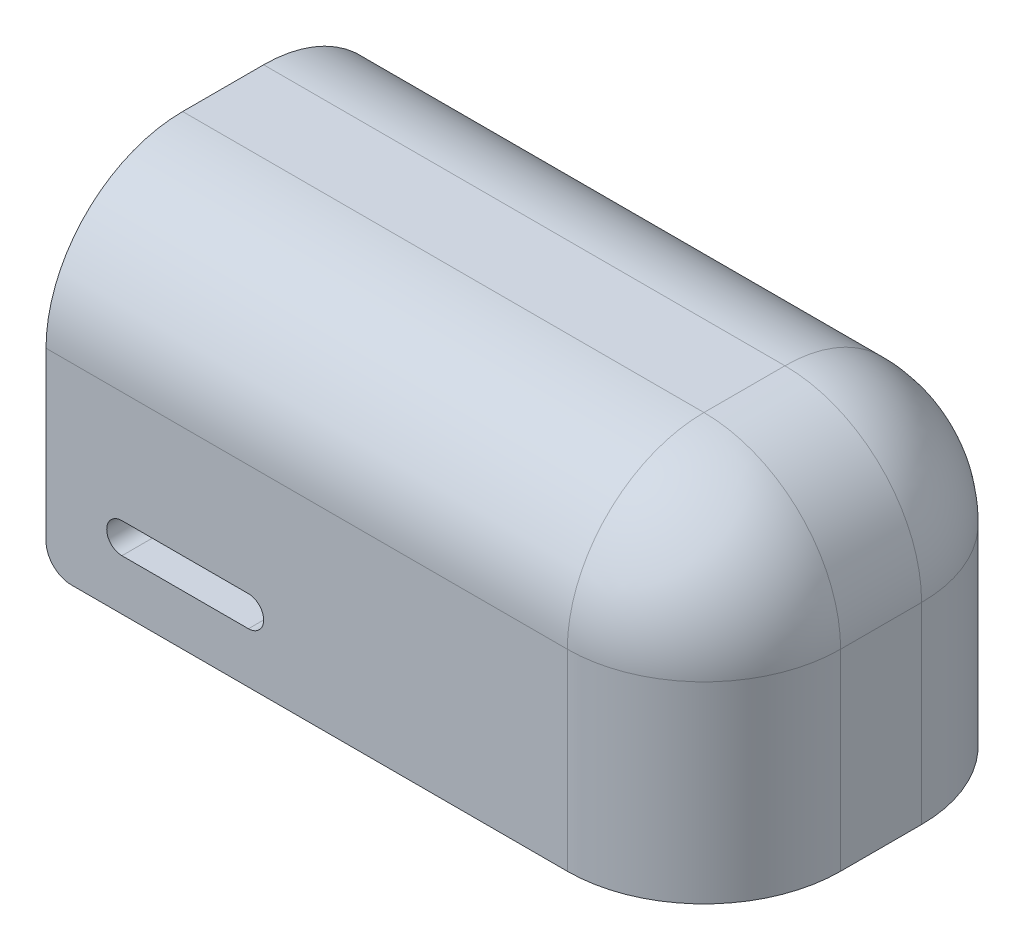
ISO-10303-21;
HEADER;
FILE_DESCRIPTION(('STEP AP214'),'2;1');
FILE_NAME('part.step','',(''),(''),'','','');
FILE_SCHEMA(('AUTOMOTIVE_DESIGN { 1 0 10303 214 1 1 1 1 }'));
ENDSEC;
DATA;
#1=APPLICATION_CONTEXT('core data for automotive mechanical design processes');
#2=APPLICATION_PROTOCOL_DEFINITION('international standard','automotive_design',2000,#1);
#3=PRODUCT_CONTEXT('',#1,'mechanical');
#4=PRODUCT('Part','Part','',(#3));
#5=PRODUCT_RELATED_PRODUCT_CATEGORY('part','',(#4));
#6=PRODUCT_DEFINITION_FORMATION('','',#4);
#7=PRODUCT_DEFINITION_CONTEXT('part definition',#1,'design');
#8=PRODUCT_DEFINITION('design','',#6,#7);
#9=PRODUCT_DEFINITION_SHAPE('','',#8);
#10=(LENGTH_UNIT() NAMED_UNIT(*) SI_UNIT(.MILLI.,.METRE.));
#11=(NAMED_UNIT(*) PLANE_ANGLE_UNIT() SI_UNIT($,.RADIAN.));
#12=(NAMED_UNIT(*) SI_UNIT($,.STERADIAN.) SOLID_ANGLE_UNIT());
#13=UNCERTAINTY_MEASURE_WITH_UNIT(LENGTH_MEASURE(1.E-05),#10,'distance_accuracy_value','');
#14=(GEOMETRIC_REPRESENTATION_CONTEXT(3) GLOBAL_UNCERTAINTY_ASSIGNED_CONTEXT((#13)) GLOBAL_UNIT_ASSIGNED_CONTEXT((#10,
#11,#12)) REPRESENTATION_CONTEXT('',''));
#15=CARTESIAN_POINT('',(0.,0.,0.));
#16=DIRECTION('',(0.,0.,1.));
#17=DIRECTION('',(1.,0.,0.));
#18=AXIS2_PLACEMENT_3D('',#15,#16,#17);
#19=CARTESIAN_POINT('',(7.5184,1.778,0.));
#20=DIRECTION('',(0.,1.,0.));
#21=DIRECTION('',(-1.,0.,0.));
#22=AXIS2_PLACEMENT_3D('',#19,#20,#21);
#23=PLANE('',#22);
#24=DIRECTION('',(0.997555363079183,0.,0.0698805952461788));
#25=VECTOR('',#24,1.);
#26=CARTESIAN_POINT('',(-1.8034,1.778,5.712552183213));
#27=LINE('',#26,#25);
#28=CARTESIAN_POINT('',(7.07465822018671,1.778,6.33447655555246));
#29=VERTEX_POINT('',#28);
#30=CARTESIAN_POINT('',(-1.80339999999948,1.77799999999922,5.71255218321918));
#31=VERTEX_POINT('',#30);
#32=EDGE_CURVE('P0_E96',#29,#31,#27,.F.);
#33=ORIENTED_EDGE('',*,*,#32,.F.);
#34=CARTESIAN_POINT('',(7.5184,1.778,0.));
#35=DIRECTION('',(0.,1.,0.));
#36=DIRECTION('',(-1.,0.,0.));
#37=AXIS2_PLACEMENT_3D('',#34,#35,#36);
#38=CIRCLE('',#37,6.35);
#39=CARTESIAN_POINT('',(7.07465822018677,1.77799999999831,-6.334476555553));
#40=VERTEX_POINT('',#39);
#41=EDGE_CURVE('P0_E83',#40,#29,#38,.F.);
#42=ORIENTED_EDGE('',*,*,#41,.F.);
#43=DIRECTION('',(-0.997555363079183,0.,0.0698805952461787));
#44=VECTOR('',#43,1.);
#45=CARTESIAN_POINT('',(7.0746582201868,1.77799999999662,-6.334476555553));
#46=LINE('',#45,#44);
#47=CARTESIAN_POINT('',(-1.80339999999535,1.77799999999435,-5.71255218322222));
#48=VERTEX_POINT('',#47);
#49=EDGE_CURVE('P0_E94',#48,#40,#46,.F.);
#50=ORIENTED_EDGE('',*,*,#49,.F.);
#51=DIRECTION('',(0.,-1.90741922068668E-13,-1.));
#52=VECTOR('',#51,1.);
#53=CARTESIAN_POINT('',(-1.80339999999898,1.77799999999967,0.));
#54=LINE('',#53,#52);
#55=EDGE_CURVE('P0_E99',#31,#48,#54,.T.);
#56=ORIENTED_EDGE('',*,*,#55,.F.);
#57=EDGE_LOOP('',(#33,#42,#50,#56));
#58=FACE_BOUND('',#57,.T.);
#59=CARTESIAN_POINT('',(7.5184,1.778,0.));
#60=DIRECTION('',(0.,-1.,0.));
#61=DIRECTION('',(1.,0.,0.));
#62=AXIS2_PLACEMENT_3D('',#59,#60,#61);
#63=CIRCLE('',#62,3.36549999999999);
#64=CARTESIAN_POINT('',(10.8839,1.778,0.));
#65=VERTEX_POINT('',#64);
#66=EDGE_CURVE('P0_E24',#65,#65,#63,.T.);
#67=ORIENTED_EDGE('',*,*,#66,.T.);
#68=EDGE_LOOP('',(#67));
#69=FACE_BOUND('',#68,.T.);
#70=ADVANCED_FACE('P0_F17',(#58,#69),#23,.T.);
#71=CARTESIAN_POINT('',(7.5184,0.,0.));
#72=DIRECTION('',(0.,-1.,0.));
#73=DIRECTION('',(1.,0.,0.));
#74=AXIS2_PLACEMENT_3D('',#71,#72,#73);
#75=CYLINDRICAL_SURFACE('',#74,3.36549999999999);
#76=ORIENTED_EDGE('',*,*,#66,.F.);
#77=EDGE_LOOP('',(#76));
#78=FACE_BOUND('',#77,.T.);
#79=CARTESIAN_POINT('',(7.5184,0.,0.));
#80=DIRECTION('',(0.,-1.,0.));
#81=DIRECTION('',(1.,0.,0.));
#82=AXIS2_PLACEMENT_3D('',#79,#80,#81);
#83=CIRCLE('',#82,3.36549999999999);
#84=CARTESIAN_POINT('',(10.8839,0.,0.));
#85=VERTEX_POINT('',#84);
#86=EDGE_CURVE('P0_E107',#85,#85,#83,.T.);
#87=ORIENTED_EDGE('',*,*,#86,.T.);
#88=EDGE_LOOP('',(#87));
#89=FACE_BOUND('',#88,.T.);
#90=ADVANCED_FACE('P0_F411',(#78,#89),#75,.F.);
#91=CARTESIAN_POINT('',(7.5184,0.,0.));
#92=DIRECTION('',(0.,1.,0.));
#93=DIRECTION('',(-1.,0.,0.));
#94=AXIS2_PLACEMENT_3D('',#91,#92,#93);
#95=CYLINDRICAL_SURFACE('',#94,6.35);
#96=DIRECTION('',(0.,1.,0.));
#97=VECTOR('',#96,1.);
#98=CARTESIAN_POINT('',(7.07465822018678,0.,-6.334476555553));
#99=LINE('',#98,#97);
#100=CARTESIAN_POINT('',(7.07465822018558,0.,-6.33447655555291));
#101=VERTEX_POINT('',#100);
#102=EDGE_CURVE('P0_E92',#40,#101,#99,.F.);
#103=ORIENTED_EDGE('',*,*,#102,.F.);
#104=ORIENTED_EDGE('',*,*,#41,.T.);
#105=DIRECTION('',(0.,1.,0.));
#106=VECTOR('',#105,1.);
#107=CARTESIAN_POINT('',(7.07465822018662,0.,6.33447655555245));
#108=LINE('',#107,#106);
#109=CARTESIAN_POINT('',(7.07465822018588,0.,6.33447655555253));
#110=VERTEX_POINT('',#109);
#111=EDGE_CURVE('P0_E89',#110,#29,#108,.T.);
#112=ORIENTED_EDGE('',*,*,#111,.F.);
#113=CARTESIAN_POINT('',(7.5184,0.,0.));
#114=DIRECTION('',(0.,1.,0.));
#115=DIRECTION('',(-1.,0.,0.));
#116=AXIS2_PLACEMENT_3D('',#113,#114,#115);
#117=CIRCLE('',#116,6.35);
#118=EDGE_CURVE('P0_E267',#110,#101,#117,.T.);
#119=ORIENTED_EDGE('',*,*,#118,.T.);
#120=EDGE_LOOP('',(#103,#104,#112,#119));
#121=FACE_BOUND('',#120,.T.);
#122=ADVANCED_FACE('P0_F87',(#121),#95,.T.);
#123=CARTESIAN_POINT('',(7.0746582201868,0.,-6.334476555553));
#124=DIRECTION('',(-0.0698805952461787,0.,-0.997555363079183));
#125=DIRECTION('',(-0.997555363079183,0.,0.0698805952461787));
#126=AXIS2_PLACEMENT_3D('',#123,#124,#125);
#127=PLANE('',#126);
#128=ORIENTED_EDGE('',*,*,#49,.T.);
#129=ORIENTED_EDGE('',*,*,#102,.T.);
#130=DIRECTION('',(-0.997555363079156,0.,0.0698805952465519));
#131=VECTOR('',#130,1.);
#132=CARTESIAN_POINT('',(7.07465822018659,0.,-6.33447655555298));
#133=LINE('',#132,#131);
#134=CARTESIAN_POINT('',(-1.80339999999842,1.02625513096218E-12,-5.71255218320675));
#135=VERTEX_POINT('',#134);
#136=EDGE_CURVE('P0_E234',#101,#135,#133,.T.);
#137=ORIENTED_EDGE('',*,*,#136,.T.);
#138=DIRECTION('',(0.,-1.,1.52108669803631E-11));
#139=VECTOR('',#138,1.);
#140=CARTESIAN_POINT('',(-1.80339999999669,0.888999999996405,-5.7125521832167));
#141=LINE('',#140,#139);
#142=EDGE_CURVE('P0_E226',#48,#135,#141,.T.);
#143=ORIENTED_EDGE('',*,*,#142,.F.);
#144=EDGE_LOOP('',(#128,#129,#137,#143));
#145=FACE_BOUND('',#144,.T.);
#146=ADVANCED_FACE('P0_F264',(#145),#127,.T.);
#147=CARTESIAN_POINT('',(-1.76784,1.739808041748,5.993831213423));
#148=CARTESIAN_POINT('',(-2.384213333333,2.401801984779,5.079030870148));
#149=CARTESIAN_POINT('',(-3.00058666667,3.06379592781,4.164230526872));
#150=CARTESIAN_POINT('',(-3.61696,3.725789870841,3.249430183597));
#151=CARTESIAN_POINT('',(-1.76784,1.740695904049,5.916651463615));
#152=CARTESIAN_POINT('',(-2.384213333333,2.387300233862,5.019399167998));
#153=CARTESIAN_POINT('',(-3.00058666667,3.033904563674,4.12214687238));
#154=CARTESIAN_POINT('',(-3.61696,3.680508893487,3.224894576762));
#155=CARTESIAN_POINT('',(-1.76784,1.752544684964,4.874964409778));
#156=CARTESIAN_POINT('',(-2.384213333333,2.193770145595,4.21045823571));
#157=CARTESIAN_POINT('',(-3.00058666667,2.634995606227,3.545952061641));
#158=CARTESIAN_POINT('',(-3.61696,3.076221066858,2.881445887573));
#159=CARTESIAN_POINT('',(-1.76784,1.771405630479,2.874999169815));
#160=CARTESIAN_POINT('',(-2.384213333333,1.885708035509,2.55046581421));
#161=CARTESIAN_POINT('',(-3.00058666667,2.00001044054,2.225932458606));
#162=CARTESIAN_POINT('',(-3.61696,2.11431284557,1.901399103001));
#163=CARTESIAN_POINT('',(-1.76784,1.78129718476,0.));
#164=CARTESIAN_POINT('',(-2.384213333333,1.724145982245,0.));
#165=CARTESIAN_POINT('',(-3.00058666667,1.66699477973,0.));
#166=CARTESIAN_POINT('',(-3.61696,1.609843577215,0.));
#167=CARTESIAN_POINT('',(-1.76784,1.771405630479,-2.874999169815));
#168=CARTESIAN_POINT('',(-2.384213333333,1.885708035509,-2.55046581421));
#169=CARTESIAN_POINT('',(-3.00058666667,2.00001044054,-2.225932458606));
#170=CARTESIAN_POINT('',(-3.61696,2.11431284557,-1.901399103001));
#171=CARTESIAN_POINT('',(-1.76784,1.752544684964,-4.874964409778));
#172=CARTESIAN_POINT('',(-2.384213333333,2.193770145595,-4.21045823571));
#173=CARTESIAN_POINT('',(-3.00058666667,2.634995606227,-3.545952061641));
#174=CARTESIAN_POINT('',(-3.61696,3.076221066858,-2.881445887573));
#175=CARTESIAN_POINT('',(-1.76784,1.740695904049,-5.916651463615));
#176=CARTESIAN_POINT('',(-2.384213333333,2.387300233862,-5.019399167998));
#177=CARTESIAN_POINT('',(-3.00058666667,3.033904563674,-4.12214687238));
#178=CARTESIAN_POINT('',(-3.61696,3.680508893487,-3.224894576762));
#179=CARTESIAN_POINT('',(-1.76784,1.739808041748,-5.993831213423));
#180=CARTESIAN_POINT('',(-2.384213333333,2.401801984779,-5.079030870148));
#181=CARTESIAN_POINT('',(-3.00058666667,3.06379592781,-4.164230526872));
#182=CARTESIAN_POINT('',(-3.61696,3.725789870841,-3.249430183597));
#183=B_SPLINE_SURFACE_WITH_KNOTS('',3,3,((#147,#148,#149,#150),(#151,#152,#153,#154),(#155,#156,
#157,#158),(#159,#160,#161,#162),(#163,#164,#165,#166),(#167,#168,#169,#170),(#171,#172,#173,
#174),(#175,#176,#177,#178),(#179,#180,#181,#182)),.UNSPECIFIED.,.F.,.F.,.F.,(4,1,1,1,1,1,4),(4,
4),(-0.02,0.,0.25,0.5,0.75,1.,1.02),(-0.02,1.02),.UNSPECIFIED.);
#184=DIRECTION('',(0.502473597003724,-0.502473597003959,-0.703591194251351));
#185=VECTOR('',#184,1.);
#186=CARTESIAN_POINT('',(-2.69240000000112,2.66700000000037,-4.46772543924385));
#187=LINE('',#186,#185);
#188=CARTESIAN_POINT('',(-3.58140000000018,3.55600000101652,-3.2228986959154));
#189=VERTEX_POINT('',#188);
#190=EDGE_CURVE('P0_E229',#189,#48,#187,.T.);
#191=CARTESIAN_POINT('',(-3.58140000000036,3.55600000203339,-3.22289869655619));
#192=CARTESIAN_POINT('',(-3.5813875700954,3.46444704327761,-3.16518984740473));
#193=CARTESIAN_POINT('',(-3.58131920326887,3.37536688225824,-3.1035610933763));
#194=CARTESIAN_POINT('',(-3.58114106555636,3.2027390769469,-2.97293216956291));
#195=CARTESIAN_POINT('',(-3.58103128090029,3.11919328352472,-2.9039295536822));
#196=CARTESIAN_POINT('',(-3.58084285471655,2.95995221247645,-2.76056326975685));
#197=CARTESIAN_POINT('',(-3.58076361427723,2.88413001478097,-2.68634054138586));
#198=CARTESIAN_POINT('',(-3.58069117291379,2.73897161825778,-2.53186985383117));
#199=CARTESIAN_POINT('',(-3.58069793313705,2.66963250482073,-2.45162463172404));
#200=CARTESIAN_POINT('',(-3.58082585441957,2.53811945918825,-2.28592912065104));
#201=CARTESIAN_POINT('',(-3.58094659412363,2.47592008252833,-2.20049908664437));
#202=CARTESIAN_POINT('',(-3.58115718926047,2.38780853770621,-2.06826557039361));
#203=CARTESIAN_POINT('',(-3.58123277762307,2.35916620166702,-2.02325917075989));
#204=CARTESIAN_POINT('',(-3.58135140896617,2.3037901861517,-1.93207430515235));
#205=CARTESIAN_POINT('',(-3.58139444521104,2.27705690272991,-1.88589559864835));
#206=CARTESIAN_POINT('',(-3.58140001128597,2.2513021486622,-1.83917031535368));
#207=B_SPLINE_CURVE_WITH_KNOTS('',3,(#191,#192,#193,#194,#195,#196,#197,#198,#199,#200,#201,
#202,#203,#204,#205,#206),.UNSPECIFIED.,.F.,.F.,(4,2,2,2,2,2,2,4),(0.,0.324569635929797,
0.649247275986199,0.967188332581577,1.28498575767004,1.60161294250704,1.76161494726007,
1.9216500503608),.UNSPECIFIED.);
#208=CARTESIAN_POINT('',(-3.58140000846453,2.25130214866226,-1.83917031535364));
#209=VERTEX_POINT('',#208);
#210=EDGE_CURVE('P0_E190',#189,#209,#207,.T.);
#211=CARTESIAN_POINT('',(-3.58140001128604,2.25130214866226,-1.83917031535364));
#212=CARTESIAN_POINT('',(-3.58139990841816,2.21518737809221,-1.77365277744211));
#213=CARTESIAN_POINT('',(-3.58129531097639,2.18100824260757,-1.70708346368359));
#214=CARTESIAN_POINT('',(-3.58098851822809,2.13249413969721,-1.60533361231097));
#215=CARTESIAN_POINT('',(-3.58085983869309,2.11668166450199,-1.57085421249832));
#216=CARTESIAN_POINT('',(-3.58055157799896,2.08594975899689,-1.50111162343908));
#217=CARTESIAN_POINT('',(-3.5803715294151,2.07104012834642,-1.46584411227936));
#218=CARTESIAN_POINT('',(-3.57996052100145,2.04215600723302,-1.39454163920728));
#219=CARTESIAN_POINT('',(-3.57972909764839,2.02819164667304,-1.35850257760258));
#220=CARTESIAN_POINT('',(-3.57921533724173,2.00124018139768,-1.28567443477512));
#221=CARTESIAN_POINT('',(-3.57893254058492,1.98826353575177,-1.2488814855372));
#222=CARTESIAN_POINT('',(-3.5783160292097,1.96332990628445,-1.17456517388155));
#223=CARTESIAN_POINT('',(-3.57798185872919,1.95138371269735,-1.13703819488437));
#224=CARTESIAN_POINT('',(-3.57726259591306,1.92855357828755,-1.06127533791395));
#225=CARTESIAN_POINT('',(-3.57687705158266,1.91768076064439,-1.02303611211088));
#226=CARTESIAN_POINT('',(-3.57605503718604,1.89704014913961,-0.945872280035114));
#227=CARTESIAN_POINT('',(-3.57561811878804,1.88728381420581,-0.906944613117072));
#228=CARTESIAN_POINT('',(-3.57469335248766,1.86891908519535,-0.828429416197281));
#229=CARTESIAN_POINT('',(-3.57420505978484,1.86032248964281,-0.788839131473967));
#230=CARTESIAN_POINT('',(-3.57317754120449,1.84432027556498,-0.709026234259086));
#231=CARTESIAN_POINT('',(-3.57263787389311,1.83692680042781,-0.668801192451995));
#232=CARTESIAN_POINT('',(-3.57150760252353,1.82337394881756,-0.587748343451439));
#233=CARTESIAN_POINT('',(-3.57091656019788,1.81722706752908,-0.546918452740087));
#234=CARTESIAN_POINT('',(-3.56968353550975,1.80621058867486,-0.464687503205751));
#235=CARTESIAN_POINT('',(-3.56904111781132,1.80135384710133,-0.423284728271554));
#236=CARTESIAN_POINT('',(-3.56770533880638,1.79296082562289,-0.339941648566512));
#237=CARTESIAN_POINT('',(-3.56701154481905,1.78943777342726,-0.29800001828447));
#238=CARTESIAN_POINT('',(-3.56557301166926,1.78375540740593,-0.213614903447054));
#239=CARTESIAN_POINT('',(-3.56482784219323,1.781609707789,-0.171170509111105));
#240=CARTESIAN_POINT('',(-3.56328654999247,1.77872485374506,-0.0858175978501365));
#241=CARTESIAN_POINT('',(-3.56248999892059,1.77799971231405,-0.0429086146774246));
#242=CARTESIAN_POINT('',(-3.56167203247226,1.778,-2.5575997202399E-12));
#243=B_SPLINE_CURVE_WITH_KNOTS('',3,(#211,#212,#213,#214,#215,#216,#217,#218,#219,#220,#221,
#222,#223,#224,#225,#226,#227,#228,#229,#230,#231,#232,#233,#234,#235,#236,#237,#238,#239,#240,
#241,#242),.UNSPECIFIED.,.F.,.F.,(4,2,2,2,2,2,2,2,2,2,2,2,2,2,2,4),(0.,0.224373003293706,
0.338155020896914,0.453007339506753,0.56894136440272,0.685968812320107,0.80410176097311,
0.923352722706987,1.04373474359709,1.16526152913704,1.28794759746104,1.41180846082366,
1.53686083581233,1.66312288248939,1.79061447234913,1.91935748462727),.UNSPECIFIED.);
#244=CARTESIAN_POINT('',(-3.56167203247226,1.77800000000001,-2.55800175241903E-12));
#245=VERTEX_POINT('',#244);
#246=EDGE_CURVE('P0_E222',#209,#245,#243,.T.);
#247=CARTESIAN_POINT('',(-3.56167203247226,1.778,-2.5575997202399E-12));
#248=CARTESIAN_POINT('',(-3.5624899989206,1.77799971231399,0.0429086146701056));
#249=CARTESIAN_POINT('',(-3.56328654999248,1.77872485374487,0.0858175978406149));
#250=CARTESIAN_POINT('',(-3.56482784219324,1.78160970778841,0.171170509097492));
#251=CARTESIAN_POINT('',(-3.56557301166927,1.78375540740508,0.213614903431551));
#252=CARTESIAN_POINT('',(-3.56701154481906,1.78943777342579,0.298000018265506));
#253=CARTESIAN_POINT('',(-3.56770533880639,1.79296082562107,0.339941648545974));
#254=CARTESIAN_POINT('',(-3.56904111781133,1.80135384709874,0.423284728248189));
#255=CARTESIAN_POINT('',(-3.56968353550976,1.80621058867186,0.464687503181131));
#256=CARTESIAN_POINT('',(-3.57091656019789,1.81722706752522,0.546918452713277));
#257=CARTESIAN_POINT('',(-3.57150760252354,1.82337394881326,0.587748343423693));
#258=CARTESIAN_POINT('',(-3.57263787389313,1.83692680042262,0.668801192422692));
#259=CARTESIAN_POINT('',(-3.5731775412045,1.84432027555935,0.709026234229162));
#260=CARTESIAN_POINT('',(-3.57420505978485,1.86032248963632,0.788839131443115));
#261=CARTESIAN_POINT('',(-3.57469335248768,1.86891908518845,0.82842941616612));
#262=CARTESIAN_POINT('',(-3.57561811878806,1.88728381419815,0.906944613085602));
#263=CARTESIAN_POINT('',(-3.57605503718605,1.89704014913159,0.945872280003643));
#264=CARTESIAN_POINT('',(-3.57687705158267,1.91768076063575,1.02303611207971));
#265=CARTESIAN_POINT('',(-3.57726259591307,1.92855357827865,1.06127533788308));
#266=CARTESIAN_POINT('',(-3.5779818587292,1.95138371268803,1.13703819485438));
#267=CARTESIAN_POINT('',(-3.57831602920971,1.96332990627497,1.17456517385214));
#268=CARTESIAN_POINT('',(-3.57893254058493,1.98826353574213,1.24888148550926));
#269=CARTESIAN_POINT('',(-3.57921533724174,2.00124018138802,1.28567443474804));
#270=CARTESIAN_POINT('',(-3.5797290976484,2.02819164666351,1.35850257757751));
#271=CARTESIAN_POINT('',(-3.57996052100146,2.04215600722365,1.39454163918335));
#272=CARTESIAN_POINT('',(-3.58037152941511,2.07104012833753,1.46584411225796));
#273=CARTESIAN_POINT('',(-3.58055157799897,2.08594975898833,1.50111162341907));
#274=CARTESIAN_POINT('',(-3.5808598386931,2.11668166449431,1.57085421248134));
#275=CARTESIAN_POINT('',(-3.5809885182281,2.13249413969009,1.60533361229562));
#276=CARTESIAN_POINT('',(-3.58129531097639,2.18100824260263,1.7070834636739));
#277=CARTESIAN_POINT('',(-3.58139990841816,2.21518737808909,1.77365277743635));
#278=CARTESIAN_POINT('',(-3.58140001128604,2.25130214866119,1.8391703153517));
#279=B_SPLINE_CURVE_WITH_KNOTS('',3,(#247,#248,#249,#250,#251,#252,#253,#254,#255,#256,#257,
#258,#259,#260,#261,#262,#263,#264,#265,#266,#267,#268,#269,#270,#271,#272,#273,#274,#275,#276,
#277,#278),.UNSPECIFIED.,.F.,.F.,(4,2,2,2,2,2,2,2,2,2,2,2,2,2,2,4),(0.,0.128743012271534,
0.256234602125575,0.382496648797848,0.507549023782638,0.631409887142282,0.754095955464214,
0.875622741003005,0.996004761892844,1.11525572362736,1.23338867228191,1.35041612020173,
1.46635014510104,1.58120246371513,1.69498448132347,1.91935748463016),.UNSPECIFIED.);
#280=CARTESIAN_POINT('',(-3.58140001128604,2.25130214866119,1.8391703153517));
#281=VERTEX_POINT('',#280);
#282=EDGE_CURVE('P0_E182',#245,#281,#279,.T.);
#283=CARTESIAN_POINT('',(-3.58140001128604,2.25130214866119,1.8391703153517));
#284=CARTESIAN_POINT('',(-3.58139417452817,2.27742444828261,1.88656231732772));
#285=CARTESIAN_POINT('',(-3.58135004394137,2.30455316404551,1.93339175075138));
#286=CARTESIAN_POINT('',(-3.58122892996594,2.36078013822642,2.02585301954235));
#287=CARTESIAN_POINT('',(-3.58115194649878,2.38987840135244,2.07148485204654));
#288=CARTESIAN_POINT('',(-3.58093730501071,2.48006861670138,2.20648425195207));
#289=CARTESIAN_POINT('',(-3.58081597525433,2.54405055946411,2.29394586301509));
#290=CARTESIAN_POINT('',(-3.58069473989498,2.67781631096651,2.46133578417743));
#291=CARTESIAN_POINT('',(-3.58069236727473,2.74745220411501,2.54138274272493));
#292=CARTESIAN_POINT('',(-3.58077154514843,2.89312464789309,2.69536152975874));
#293=CARTESIAN_POINT('',(-3.58085305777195,2.96915829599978,2.76929610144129));
#294=CARTESIAN_POINT('',(-3.58104113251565,3.12683805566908,2.9103133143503));
#295=CARTESIAN_POINT('',(-3.58114760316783,3.20846292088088,2.97741972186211));
#296=CARTESIAN_POINT('',(-3.58132113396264,3.37788637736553,3.10530237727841));
#297=CARTESIAN_POINT('',(-3.58138776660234,3.46574100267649,3.16600439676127));
#298=CARTESIAN_POINT('',(-3.58140000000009,3.55600000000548,3.22289869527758));
#299=B_SPLINE_CURVE_WITH_KNOTS('',3,(#283,#284,#285,#286,#287,#288,#289,#290,#291,#292,#293,
#294,#295,#296,#297,#298),.UNSPECIFIED.,.F.,.F.,(4,2,2,2,2,2,2,4),(0.,0.162317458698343,
0.324635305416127,0.64930466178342,0.967237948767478,1.28502776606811,1.60167064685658,
1.92165313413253),.UNSPECIFIED.);
#300=CARTESIAN_POINT('',(-3.58140000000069,3.55600000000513,3.22289869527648));
#301=VERTEX_POINT('',#300);
#302=EDGE_CURVE('P0_E179',#281,#301,#299,.T.);
#303=DIRECTION('',(-0.502473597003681,0.502473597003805,-0.703591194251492));
#304=VECTOR('',#303,1.);
#305=CARTESIAN_POINT('',(-2.69240000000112,2.66700000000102,4.4677254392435));
#306=LINE('',#305,#304);
#307=EDGE_CURVE('P0_E181',#31,#301,#306,.T.);
#308=ORIENTED_EDGE('',*,*,#190,.F.);
#309=ORIENTED_EDGE('',*,*,#210,.T.);
#310=ORIENTED_EDGE('',*,*,#246,.T.);
#311=ORIENTED_EDGE('',*,*,#282,.T.);
#312=ORIENTED_EDGE('',*,*,#302,.T.);
#313=ORIENTED_EDGE('',*,*,#307,.F.);
#314=ORIENTED_EDGE('',*,*,#55,.T.);
#315=EDGE_LOOP('',(#308,#309,#310,#311,#312,#313,#314));
#316=FACE_BOUND('',#315,.T.);
#317=ADVANCED_FACE('P0_F159',(#316),#183,.T.);
#318=CARTESIAN_POINT('',(-1.8034,0.,5.712552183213));
#319=DIRECTION('',(-0.0698805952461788,0.,0.997555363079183));
#320=DIRECTION('',(0.997555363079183,0.,0.0698805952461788));
#321=AXIS2_PLACEMENT_3D('',#318,#319,#320);
#322=PLANE('',#321);
#323=DIRECTION('',(0.997555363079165,0.,0.0698805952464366));
#324=VECTOR('',#323,1.);
#325=CARTESIAN_POINT('',(-1.80340000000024,0.,5.71255218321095));
#326=LINE('',#325,#324);
#327=CARTESIAN_POINT('',(-1.80340000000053,-1.92867619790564E-13,5.71255218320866));
#328=VERTEX_POINT('',#327);
#329=EDGE_CURVE('P0_E106',#328,#110,#326,.T.);
#330=ORIENTED_EDGE('',*,*,#329,.T.);
#331=ORIENTED_EDGE('',*,*,#111,.T.);
#332=ORIENTED_EDGE('',*,*,#32,.T.);
#333=DIRECTION('',(0.,1.,9.2262635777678E-12));
#334=VECTOR('',#333,1.);
#335=CARTESIAN_POINT('',(-1.80340000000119,0.889000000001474,5.7125521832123));
#336=LINE('',#335,#334);
#337=EDGE_CURVE('P0_E178',#328,#31,#336,.T.);
#338=ORIENTED_EDGE('',*,*,#337,.F.);
#339=EDGE_LOOP('',(#330,#331,#332,#338));
#340=FACE_BOUND('',#339,.T.);
#341=ADVANCED_FACE('P0_F104',(#340),#322,.T.);
#342=CARTESIAN_POINT('',(7.5184,0.,0.));
#343=DIRECTION('',(0.,1.,0.));
#344=DIRECTION('',(-1.,0.,0.));
#345=AXIS2_PLACEMENT_3D('',#342,#343,#344);
#346=PLANE('',#345);
#347=ORIENTED_EDGE('',*,*,#136,.F.);
#348=ORIENTED_EDGE('',*,*,#118,.F.);
#349=ORIENTED_EDGE('',*,*,#329,.F.);
#350=DIRECTION('',(0.,-1.69612627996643E-13,1.));
#351=VECTOR('',#350,1.);
#352=CARTESIAN_POINT('',(-1.80340000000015,0.,0.));
#353=LINE('',#352,#351);
#354=EDGE_CURVE('P0_E128',#135,#328,#353,.T.);
#355=ORIENTED_EDGE('',*,*,#354,.F.);
#356=EDGE_LOOP('',(#347,#348,#349,#355));
#357=FACE_BOUND('',#356,.T.);
#358=ORIENTED_EDGE('',*,*,#86,.F.);
#359=EDGE_LOOP('',(#358));
#360=FACE_BOUND('',#359,.T.);
#361=ADVANCED_FACE('P0_F157',(#357,#360),#346,.F.);
#362=CARTESIAN_POINT('',(-1.76784,1.784570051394,-5.763051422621));
#363=CARTESIAN_POINT('',(-2.384213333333,2.394190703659,-4.887731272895));
#364=CARTESIAN_POINT('',(-3.00058666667,3.003811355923,-4.012411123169));
#365=CARTESIAN_POINT('',(-3.61696,3.613432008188,-3.137090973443));
#366=CARTESIAN_POINT('',(-1.76784,1.77052670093,-5.762816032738));
#367=CARTESIAN_POINT('',(-2.384213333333,2.382398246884,-4.891575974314));
#368=CARTESIAN_POINT('',(-3.00058666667,2.994269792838,-4.020335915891));
#369=CARTESIAN_POINT('',(-3.61696,3.606141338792,-3.149095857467));
#370=CARTESIAN_POINT('',(-1.76784,1.158285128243,-5.752553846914));
#371=CARTESIAN_POINT('',(-2.384213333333,1.868287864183,-5.059191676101));
#372=CARTESIAN_POINT('',(-3.00058666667,2.578290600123,-4.365829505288));
#373=CARTESIAN_POINT('',(-3.61696,3.288293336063,-3.672467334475));
#374=CARTESIAN_POINT('',(-1.76784,0.5320002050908,-5.742056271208));
#375=CARTESIAN_POINT('',(-2.384213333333,1.342385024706,-5.230652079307));
#376=CARTESIAN_POINT('',(-3.00058666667,2.152769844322,-4.719247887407));
#377=CARTESIAN_POINT('',(-3.61696,2.963154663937,-4.207843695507));
#378=CARTESIAN_POINT('',(-1.76784,-0.0802413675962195,-5.731794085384));
#379=CARTESIAN_POINT('',(-2.384213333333,0.8282746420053,-5.398267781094));
#380=CARTESIAN_POINT('',(-3.00058666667,1.736790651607,-5.064741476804));
#381=CARTESIAN_POINT('',(-3.61696,2.645306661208,-4.731215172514));
#382=CARTESIAN_POINT('',(-1.76784,-0.0942847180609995,-5.731558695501));
#383=CARTESIAN_POINT('',(-2.384213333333,0.8164821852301,-5.402112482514));
#384=CARTESIAN_POINT('',(-3.00058666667,1.727249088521,-5.072666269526));
#385=CARTESIAN_POINT('',(-3.61696,2.638015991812,-4.743220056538));
#386=B_SPLINE_SURFACE_WITH_KNOTS('',3,3,((#362,#363,#364,#365),(#366,#367,#368,#369),(#370,#371,
#372,#373),(#374,#375,#376,#377),(#378,#379,#380,#381),(#382,#383,#384,#385)),.UNSPECIFIED.,.F.,
.F.,.F.,(4,1,1,4),(4,4),(-0.02347608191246,0.,1.,1.023476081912),(-0.02,1.02),.UNSPECIFIED.);
#387=CARTESIAN_POINT('',(-3.58128887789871,2.60757035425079,-4.72697968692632));
#388=CARTESIAN_POINT('',(-3.40993378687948,2.35624955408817,-4.82197036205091));
#389=CARTESIAN_POINT('',(-3.23857869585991,2.10492875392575,-4.91696103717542));
#390=CARTESIAN_POINT('',(-2.8958685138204,1.60228715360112,-5.10694238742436));
#391=CARTESIAN_POINT('',(-2.72451342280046,1.35096635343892,-5.20193306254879));
#392=CARTESIAN_POINT('',(-2.30323888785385,0.733097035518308,-5.43546655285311));
#393=CARTESIAN_POINT('',(-2.05331944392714,0.366548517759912,-5.57400936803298));
#394=CARTESIAN_POINT('',(-1.80340000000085,1.27031225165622E-12,-5.71255218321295));
#395=B_SPLINE_CURVE_WITH_KNOTS('',3,(#387,#388,#389,#390,#391,#392,#393,#394),.UNSPECIFIED.,.F.,
.F.,(4,2,2,4),(0.,0.955997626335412,1.91199525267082,3.30630687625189),.UNSPECIFIED.);
#396=CARTESIAN_POINT('',(-3.58134669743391,2.6075923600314,-4.7271422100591));
#397=VERTEX_POINT('',#396);
#398=EDGE_CURVE('P0_E135',#397,#135,#395,.T.);
#399=DIRECTION('',(0.,0.533333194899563,0.845905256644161));
#400=VECTOR('',#399,1.);
#401=CARTESIAN_POINT('',(-3.5814,2.60746609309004,-4.72734249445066));
#402=LINE('',#401,#400);
#403=EDGE_CURVE('P0_E124',#397,#189,#402,.T.);
#404=ORIENTED_EDGE('',*,*,#190,.T.);
#405=ORIENTED_EDGE('',*,*,#142,.T.);
#406=ORIENTED_EDGE('',*,*,#398,.F.);
#407=ORIENTED_EDGE('',*,*,#403,.T.);
#408=EDGE_LOOP('',(#404,#405,#406,#407));
#409=FACE_BOUND('',#408,.T.);
#410=ADVANCED_FACE('P0_F146',(#409),#386,.T.);
#411=CARTESIAN_POINT('',(-16.51,5.588,0.));
#412=DIRECTION('',(-1.,0.,0.));
#413=DIRECTION('',(0.,0.,1.));
#414=AXIS2_PLACEMENT_3D('',#411,#412,#413);
#415=CYLINDRICAL_SURFACE('',#414,3.80999999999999);
#416=CARTESIAN_POINT('',(-16.51,5.588,0.));
#417=DIRECTION('',(-1.,0.,0.));
#418=DIRECTION('',(0.,0.,1.));
#419=AXIS2_PLACEMENT_3D('',#416,#417,#418);
#420=CIRCLE('',#419,3.80999999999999);
#421=CARTESIAN_POINT('',(-16.51,5.588,3.80999999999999));
#422=VERTEX_POINT('',#421);
#423=EDGE_CURVE('P0_E175',#422,#422,#420,.F.);
#424=ORIENTED_EDGE('',*,*,#423,.F.);
#425=EDGE_LOOP('',(#424));
#426=FACE_BOUND('',#425,.T.);
#427=ORIENTED_EDGE('',*,*,#210,.F.);
#428=CARTESIAN_POINT('',(-3.58140000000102,5.588,0.));
#429=DIRECTION('',(-1.,0.,0.));
#430=DIRECTION('',(0.,0.,1.));
#431=AXIS2_PLACEMENT_3D('',#428,#429,#430);
#432=CIRCLE('',#431,3.80999999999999);
#433=EDGE_CURVE('P0_E121',#189,#301,#432,.F.);
#434=ORIENTED_EDGE('',*,*,#433,.T.);
#435=ORIENTED_EDGE('',*,*,#302,.F.);
#436=ORIENTED_EDGE('',*,*,#282,.F.);
#437=ORIENTED_EDGE('',*,*,#246,.F.);
#438=EDGE_LOOP('',(#427,#434,#435,#436,#437));
#439=FACE_BOUND('',#438,.T.);
#440=ADVANCED_FACE('P0_F144',(#426,#439),#415,.F.);
#441=CARTESIAN_POINT('',(-1.76784,-0.0942847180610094,5.731558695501));
#442=CARTESIAN_POINT('',(-2.384213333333,0.816482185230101,5.402112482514));
#443=CARTESIAN_POINT('',(-3.00058666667,1.727249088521,5.072666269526));
#444=CARTESIAN_POINT('',(-3.61696,2.638015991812,4.743220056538));
#445=CARTESIAN_POINT('',(-1.76784,-0.0802413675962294,5.731794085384));
#446=CARTESIAN_POINT('',(-2.384213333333,0.828274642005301,5.398267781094));
#447=CARTESIAN_POINT('',(-3.00058666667,1.736790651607,5.064741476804));
#448=CARTESIAN_POINT('',(-3.61696,2.645306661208,4.731215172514));
#449=CARTESIAN_POINT('',(-1.76784,0.532000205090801,5.742056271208));
#450=CARTESIAN_POINT('',(-2.384213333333,1.342385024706,5.230652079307));
#451=CARTESIAN_POINT('',(-3.00058666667,2.152769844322,4.719247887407));
#452=CARTESIAN_POINT('',(-3.61696,2.963154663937,4.207843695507));
#453=CARTESIAN_POINT('',(-1.76784,1.158285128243,5.752553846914));
#454=CARTESIAN_POINT('',(-2.384213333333,1.868287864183,5.059191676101));
#455=CARTESIAN_POINT('',(-3.00058666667,2.578290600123,4.365829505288));
#456=CARTESIAN_POINT('',(-3.61696,3.288293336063,3.672467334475));
#457=CARTESIAN_POINT('',(-1.76784,1.77052670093,5.762816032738));
#458=CARTESIAN_POINT('',(-2.384213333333,2.382398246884,4.891575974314));
#459=CARTESIAN_POINT('',(-3.00058666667,2.994269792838,4.020335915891));
#460=CARTESIAN_POINT('',(-3.61696,3.606141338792,3.149095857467));
#461=CARTESIAN_POINT('',(-1.76784,1.784570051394,5.763051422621));
#462=CARTESIAN_POINT('',(-2.384213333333,2.394190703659,4.887731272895));
#463=CARTESIAN_POINT('',(-3.00058666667,3.003811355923,4.012411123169));
#464=CARTESIAN_POINT('',(-3.61696,3.613432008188,3.137090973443));
#465=B_SPLINE_SURFACE_WITH_KNOTS('',3,3,((#441,#442,#443,#444),(#445,#446,#447,#448),(#449,#450,
#451,#452),(#453,#454,#455,#456),(#457,#458,#459,#460),(#461,#462,#463,#464)),.UNSPECIFIED.,.F.,
.F.,.F.,(4,1,1,4),(4,4),(-0.02347608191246,0.,1.,1.023476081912),(-0.02,1.02),.UNSPECIFIED.);
#466=CARTESIAN_POINT('',(-1.80340000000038,5.83632805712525E-13,5.71255218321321));
#467=CARTESIAN_POINT('',(-1.97475509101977,0.251320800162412,5.61756150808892));
#468=CARTESIAN_POINT('',(-2.14611018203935,0.502641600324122,5.52257083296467));
#469=CARTESIAN_POINT('',(-2.4888203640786,1.00528320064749,5.3325894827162));
#470=CARTESIAN_POINT('',(-2.66017545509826,1.25660400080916,5.23759880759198));
#471=CARTESIAN_POINT('',(-3.08144923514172,1.87447221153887,5.00406573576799));
#472=CARTESIAN_POINT('',(-3.33136792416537,2.241019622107,4.86552333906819));
#473=CARTESIAN_POINT('',(-3.58128661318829,2.60756703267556,4.72698094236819));
#474=B_SPLINE_CURVE_WITH_KNOTS('',3,(#466,#467,#468,#469,#470,#471,#472,#473),.UNSPECIFIED.,.F.,
.F.,(4,2,2,4),(0.,0.955997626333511,1.91199525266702,3.30630266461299),.UNSPECIFIED.);
#475=CARTESIAN_POINT('',(-3.58134561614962,2.60758945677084,4.72714670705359));
#476=VERTEX_POINT('',#475);
#477=EDGE_CURVE('P0_E125',#328,#476,#474,.T.);
#478=DIRECTION('',(0.,-0.533333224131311,0.845905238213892));
#479=VECTOR('',#478,1.);
#480=CARTESIAN_POINT('',(-3.5814,3.55600000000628,3.22289869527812));
#481=LINE('',#480,#479);
#482=EDGE_CURVE('P0_E120',#301,#476,#481,.T.);
#483=ORIENTED_EDGE('',*,*,#477,.F.);
#484=ORIENTED_EDGE('',*,*,#337,.T.);
#485=ORIENTED_EDGE('',*,*,#307,.T.);
#486=ORIENTED_EDGE('',*,*,#482,.T.);
#487=EDGE_LOOP('',(#483,#484,#485,#486));
#488=FACE_BOUND('',#487,.T.);
#489=ADVANCED_FACE('P0_F137',(#488),#465,.T.);
#490=CARTESIAN_POINT('',(-16.51,5.588,0.));
#491=DIRECTION('',(-1.,0.,0.));
#492=DIRECTION('',(0.,0.,1.));
#493=AXIS2_PLACEMENT_3D('',#490,#491,#492);
#494=PLANE('',#493);
#495=CARTESIAN_POINT('',(-16.51,5.588,0.));
#496=DIRECTION('',(1.,0.,0.));
#497=DIRECTION('',(0.,0.,-1.));
#498=AXIS2_PLACEMENT_3D('',#495,#496,#497);
#499=CIRCLE('',#498,5.588);
#500=CARTESIAN_POINT('',(-16.51,5.588,-5.588));
#501=VERTEX_POINT('',#500);
#502=EDGE_CURVE('P0_E115',#501,#501,#499,.T.);
#503=ORIENTED_EDGE('',*,*,#502,.F.);
#504=EDGE_LOOP('',(#503));
#505=FACE_BOUND('',#504,.T.);
#506=ORIENTED_EDGE('',*,*,#423,.T.);
#507=EDGE_LOOP('',(#506));
#508=FACE_BOUND('',#507,.T.);
#509=ADVANCED_FACE('P0_F143',(#505,#508),#494,.T.);
#510=CARTESIAN_POINT('',(-1.76784,-0.0560148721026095,-5.963010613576));
#511=CARTESIAN_POINT('',(-2.384213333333,0.914909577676,-5.582434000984));
#512=CARTESIAN_POINT('',(-3.00058666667,1.885834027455,-5.201857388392));
#513=CARTESIAN_POINT('',(-3.61696,2.856758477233,-4.821280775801));
#514=CARTESIAN_POINT('',(-1.76784,-0.0547126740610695,-5.886069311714));
#515=CARTESIAN_POINT('',(-2.384213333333,0.8936403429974,-5.518907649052));
#516=CARTESIAN_POINT('',(-3.00058666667,1.841993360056,-5.151745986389));
#517=CARTESIAN_POINT('',(-3.61696,2.790346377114,-4.784584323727));
#518=CARTESIAN_POINT('',(-1.76784,-0.0373344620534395,-4.847713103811));
#519=CARTESIAN_POINT('',(-2.384213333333,0.6097962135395,-4.655562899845));
#520=CARTESIAN_POINT('',(-3.00058666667,1.256926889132,-4.46341269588));
#521=CARTESIAN_POINT('',(-3.61696,1.904057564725,-4.271262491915));
#522=CARTESIAN_POINT('',(-1.76784,-0.00967174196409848,-2.857078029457));
#523=CARTESIAN_POINT('',(-2.384213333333,0.157971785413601,-2.84317777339));
#524=CARTESIAN_POINT('',(-3.00058666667,0.325615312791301,-2.829277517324));
#525=CARTESIAN_POINT('',(-3.61696,0.493258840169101,-2.815377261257));
#526=CARTESIAN_POINT('',(-1.76784,0.00483587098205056,0.));
#527=CARTESIAN_POINT('',(-2.384213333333,-0.0789858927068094,0.));
#528=CARTESIAN_POINT('',(-3.00058666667,-0.162807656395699,0.));
#529=CARTESIAN_POINT('',(-3.61696,-0.246629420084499,0.));
#530=CARTESIAN_POINT('',(-1.76784,-0.0096717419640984,2.857078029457));
#531=CARTESIAN_POINT('',(-2.384213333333,0.157971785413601,2.84317777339));
#532=CARTESIAN_POINT('',(-3.00058666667,0.325615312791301,2.829277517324));
#533=CARTESIAN_POINT('',(-3.61696,0.493258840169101,2.815377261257));
#534=CARTESIAN_POINT('',(-1.76784,-0.0373344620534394,4.847713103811));
#535=CARTESIAN_POINT('',(-2.384213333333,0.609796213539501,4.655562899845));
#536=CARTESIAN_POINT('',(-3.00058666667,1.256926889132,4.46341269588));
#537=CARTESIAN_POINT('',(-3.61696,1.904057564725,4.271262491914));
#538=CARTESIAN_POINT('',(-1.76784,-0.0547126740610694,5.886069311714));
#539=CARTESIAN_POINT('',(-2.384213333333,0.893640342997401,5.518907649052));
#540=CARTESIAN_POINT('',(-3.00058666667,1.841993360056,5.151745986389));
#541=CARTESIAN_POINT('',(-3.61696,2.790346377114,4.784584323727));
#542=CARTESIAN_POINT('',(-1.76784,-0.0560148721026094,5.963010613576));
#543=CARTESIAN_POINT('',(-2.384213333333,0.914909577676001,5.582434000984));
#544=CARTESIAN_POINT('',(-3.00058666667,1.885834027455,5.201857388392));
#545=CARTESIAN_POINT('',(-3.61696,2.856758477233,4.821280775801));
#546=B_SPLINE_SURFACE_WITH_KNOTS('',3,3,((#510,#511,#512,#513),(#514,#515,#516,#517),(#518,#519,
#520,#521),(#522,#523,#524,#525),(#526,#527,#528,#529),(#530,#531,#532,#533),(#534,#535,#536,
#537),(#538,#539,#540,#541),(#542,#543,#544,#545)),.UNSPECIFIED.,.F.,.F.,.F.,(4,1,1,1,1,1,4),(4,
4),(-0.02,0.,0.25,0.5,0.75,1.,1.02),(-0.02,1.02),.UNSPECIFIED.);
#547=CARTESIAN_POINT('',(-3.58115045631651,2.60756702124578,4.72718240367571));
#548=CARTESIAN_POINT('',(-3.58115305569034,2.55793710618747,4.69586828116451));
#549=CARTESIAN_POINT('',(-3.58115565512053,2.50881072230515,4.66375696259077));
#550=CARTESIAN_POINT('',(-3.58116085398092,2.41160731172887,4.59798387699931));
#551=CARTESIAN_POINT('',(-3.58116345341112,2.36353028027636,4.56432211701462));
#552=CARTESIAN_POINT('',(-3.58116865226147,2.26846597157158,4.49549075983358));
#553=CARTESIAN_POINT('',(-3.58117125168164,2.22147872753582,4.4603211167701));
#554=CARTESIAN_POINT('',(-3.58117645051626,2.12863409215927,4.38851646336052));
#555=CARTESIAN_POINT('',(-3.58117904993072,2.08277675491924,4.35188138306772));
#556=CARTESIAN_POINT('',(-3.58118424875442,1.99223213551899,4.27718832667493));
#557=CARTESIAN_POINT('',(-3.58118684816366,1.94754491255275,4.23913027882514));
#558=CARTESIAN_POINT('',(-3.58119204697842,1.85938071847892,4.16163373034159));
#559=CARTESIAN_POINT('',(-3.58119464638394,1.81590379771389,4.12219517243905));
#560=CARTESIAN_POINT('',(-3.58119984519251,1.73020042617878,4.04198003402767));
#561=CARTESIAN_POINT('',(-3.58120244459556,1.68797400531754,4.00120342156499));
#562=CARTESIAN_POINT('',(-3.58120764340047,1.60481186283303,3.91835459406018));
#563=CARTESIAN_POINT('',(-3.58121024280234,1.56387614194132,3.87628237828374));
#564=CARTESIAN_POINT('',(-3.58121544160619,1.48333563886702,3.79088475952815));
#565=CARTESIAN_POINT('',(-3.58121804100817,1.44373082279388,3.74755938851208));
#566=CARTESIAN_POINT('',(-3.58122323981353,1.36589237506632,3.65969787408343));
#567=CARTESIAN_POINT('',(-3.58122583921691,1.32765867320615,3.61516179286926));
#568=CARTESIAN_POINT('',(-3.58123103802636,1.2526027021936,3.52492127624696));
#569=CARTESIAN_POINT('',(-3.58123363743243,1.21578032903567,3.47921692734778));
#570=CARTESIAN_POINT('',(-3.58123883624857,1.14358726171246,3.38668229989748));
#571=CARTESIAN_POINT('',(-3.58124143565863,1.10821643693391,3.33985212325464));
#572=CARTESIAN_POINT('',(-3.58124663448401,1.03896670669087,3.24510827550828));
#573=CARTESIAN_POINT('',(-3.58124923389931,1.00508765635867,3.1971947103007));
#574=CARTESIAN_POINT('',(-3.58125443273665,0.93886170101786,3.10032652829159));
#575=CARTESIAN_POINT('',(-3.58125703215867,0.906514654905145,3.05137200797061));
#576=CARTESIAN_POINT('',(-3.58126223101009,0.843392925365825,2.95246438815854));
#577=CARTESIAN_POINT('',(-3.58126483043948,0.812618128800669,2.90251136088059));
#578=CARTESIAN_POINT('',(-3.5812700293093,0.752681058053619,2.80164915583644));
#579=CARTESIAN_POINT('',(-3.58127262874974,0.723518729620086,2.75074001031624));
#580=CARTESIAN_POINT('',(-3.58127782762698,0.666846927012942,2.64800837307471));
#581=CARTESIAN_POINT('',(-3.58128042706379,0.639337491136,2.59618586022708));
#582=CARTESIAN_POINT('',(-3.58128562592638,0.585986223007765,2.49168477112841));
#583=CARTESIAN_POINT('',(-3.58128822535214,0.560144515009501,2.43900613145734));
#584=CARTESIAN_POINT('',(-3.58129342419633,0.510143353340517,2.33284983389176));
#585=CARTESIAN_POINT('',(-3.58129602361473,0.485984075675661,2.27937209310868));
#586=CARTESIAN_POINT('',(-3.58130122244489,0.439362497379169,2.17167467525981));
#587=CARTESIAN_POINT('',(-3.58130382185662,0.416900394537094,2.11745491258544));
#588=CARTESIAN_POINT('',(-3.58130902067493,0.373687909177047,2.00833050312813));
#589=CARTESIAN_POINT('',(-3.58131162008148,0.352937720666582,1.95342577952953));
#590=CARTESIAN_POINT('',(-3.58131681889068,0.313163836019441,1.84298849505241));
#591=CARTESIAN_POINT('',(-3.58131941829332,0.294140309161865,1.78745587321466));
#592=CARTESIAN_POINT('',(-3.58132461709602,0.257834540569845,1.67581983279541));
#593=CARTESIAN_POINT('',(-3.58132721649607,0.240552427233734,1.61971637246));
#594=CARTESIAN_POINT('',(-3.58133241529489,0.207744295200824,1.50699569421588));
#595=CARTESIAN_POINT('',(-3.58133501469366,0.192218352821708,1.45037845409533));
#596=CARTESIAN_POINT('',(-3.58134021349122,0.162937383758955,1.33668725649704));
#597=CARTESIAN_POINT('',(-3.58134281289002,0.149182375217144,1.27961329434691));
#598=CARTESIAN_POINT('',(-3.58134801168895,0.123458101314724,1.16506569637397));
#599=CARTESIAN_POINT('',(-3.58135061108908,0.111488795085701,1.10759206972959));
#600=CARTESIAN_POINT('',(-3.581355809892,0.0893507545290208,0.992302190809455));
#601=CARTESIAN_POINT('',(-3.58135840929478,0.0791819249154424,0.934485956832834));
#602=CARTESIAN_POINT('',(-3.58136360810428,0.0606596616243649,0.818567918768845));
#603=CARTESIAN_POINT('',(-3.58136620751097,0.0523060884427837,0.760466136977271));
#604=CARTESIAN_POINT('',(-3.58137140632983,0.0374291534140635,0.64403405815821));
#605=CARTESIAN_POINT('',(-3.58137400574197,0.0309056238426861,0.585703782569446));
#606=CARTESIAN_POINT('',(-3.58137920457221,0.0197035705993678,0.468871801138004));
#607=CARTESIAN_POINT('',(-3.58138180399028,0.0150248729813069,0.410370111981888));
#608=CARTESIAN_POINT('',(-3.58138700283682,0.00752727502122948,0.293252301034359));
#609=CARTESIAN_POINT('',(-3.58138960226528,0.00470822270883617,0.234636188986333));
#610=CARTESIAN_POINT('',(-3.58139480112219,0.000944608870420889,0.117346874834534));
#611=CARTESIAN_POINT('',(-3.58139740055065,-4.80544221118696E-08,0.0586736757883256));
#612=CARTESIAN_POINT('',(-3.5814,0.,0.));
#613=B_SPLINE_CURVE_WITH_KNOTS('',3,(#547,#548,#549,#550,#551,#552,#553,#554,#555,#556,#557,
#558,#559,#560,#561,#562,#563,#564,#565,#566,#567,#568,#569,#570,#571,#572,#573,#574,#575,#576,
#577,#578,#579,#580,#581,#582,#583,#584,#585,#586,#587,#588,#589,#590,#591,#592,#593,#594,#595,
#596,#597,#598,#599,#600,#601,#602,#603,#604,#605,#606,#607,#608,#609,#610,#611,#612),
.UNSPECIFIED.,.F.,.F.,(4,2,2,2,2,2,2,2,2,2,2,2,2,2,2,2,2,2,2,2,2,2,2,2,2,2,2,2,2,2,2,2,4),(0.,
0.176040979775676,0.352081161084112,0.528126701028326,0.704180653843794,0.880243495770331,
1.0563136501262,1.23238801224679,1.40846247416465,1.58453244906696,1.7605933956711,
1.93664134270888,2.11267341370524,2.28868835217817,2.46468704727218,2.64067305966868,
2.81665314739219,2.99263731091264,3.16863457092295,3.34465021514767,3.5206863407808,
3.6967423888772,3.87281567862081,4.04890194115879,4.22499585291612,4.40109156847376,
4.57718325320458,4.75326561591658,4.92933444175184,5.10538712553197,5.28142320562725,
5.45744489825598,5.63345763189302),.UNSPECIFIED.);
#614=CARTESIAN_POINT('',(-3.5814,0.,0.));
#615=VERTEX_POINT('',#614);
#616=EDGE_CURVE('P0_E11',#615,#476,#613,.F.);
#617=CARTESIAN_POINT('',(-3.5814,0.,0.));
#618=CARTESIAN_POINT('',(-3.58139745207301,-4.80560525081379E-08,-0.0586736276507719));
#619=CARTESIAN_POINT('',(-3.5813949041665,0.000944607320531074,-0.117346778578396));
#620=CARTESIAN_POINT('',(-3.58138980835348,0.00470821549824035,-0.234635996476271));
#621=CARTESIAN_POINT('',(-3.58138726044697,0.00752726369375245,-0.293252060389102));
#622=CARTESIAN_POINT('',(-3.58138216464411,0.015024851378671,-0.410369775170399));
#623=CARTESIAN_POINT('',(-3.58137961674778,0.0197035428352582,-0.46887141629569));
#624=CARTESIAN_POINT('',(-3.58137452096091,0.0309055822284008,-0.585703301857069));
#625=CARTESIAN_POINT('',(-3.58137197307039,0.0374291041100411,-0.644033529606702));
#626=CARTESIAN_POINT('',(-3.58136687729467,0.0523060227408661,-0.760465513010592));
#627=CARTESIAN_POINT('',(-3.58136432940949,0.0606595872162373,-0.818567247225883));
#628=CARTESIAN_POINT('',(-3.58135923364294,0.0791818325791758,-0.93448519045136));
#629=CARTESIAN_POINT('',(-3.5813566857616,0.0893506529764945,-0.992301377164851));
#630=CARTESIAN_POINT('',(-3.5813515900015,0.111488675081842,-1.10759116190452));
#631=CARTESIAN_POINT('',(-3.58134904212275,0.123457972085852,-1.16506474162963));
#632=CARTESIAN_POINT('',(-3.58134394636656,0.149182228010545,-1.27961224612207));
#633=CARTESIAN_POINT('',(-3.58134139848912,0.162937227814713,-1.33668616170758));
#634=CARTESIAN_POINT('',(-3.58133630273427,0.19221818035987,-1.45037726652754));
#635=CARTESIAN_POINT('',(-3.58133375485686,0.207744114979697,-1.50699446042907));
#636=CARTESIAN_POINT('',(-3.58132865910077,0.240552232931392,-1.6197150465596));
#637=CARTESIAN_POINT('',(-3.5813261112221,0.257834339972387,-1.67581846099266));
#638=CARTESIAN_POINT('',(-3.58132101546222,0.294140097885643,-1.78745440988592));
#639=CARTESIAN_POINT('',(-3.58131846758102,0.313163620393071,-1.84298698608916));
#640=CARTESIAN_POINT('',(-3.58131337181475,0.352937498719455,-1.95342417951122));
#641=CARTESIAN_POINT('',(-3.58131082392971,0.373687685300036,-2.00832885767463));
#642=CARTESIAN_POINT('',(-3.58130572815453,0.416900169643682,-2.11745317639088));
#643=CARTESIAN_POINT('',(-3.58130318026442,0.439362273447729,-2.17167289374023));
#644=CARTESIAN_POINT('',(-3.58129808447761,0.485983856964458,-2.27937022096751));
#645=CARTESIAN_POINT('',(-3.58129553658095,0.510143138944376,-2.33284791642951));
#646=CARTESIAN_POINT('',(-3.5812904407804,0.56014431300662,-2.43900412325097));
#647=CARTESIAN_POINT('',(-3.58128789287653,0.585986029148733,-2.49168271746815));
#648=CARTESIAN_POINT('',(-3.58128279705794,0.639337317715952,-2.5961837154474));
#649=CARTESIAN_POINT('',(-3.58128024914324,0.666846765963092,-2.64800618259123));
#650=CARTESIAN_POINT('',(-3.58127515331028,0.723518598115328,-2.75073772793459));
#651=CARTESIAN_POINT('',(-3.58127260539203,0.752680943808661,-2.8016468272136));
#652=CARTESIAN_POINT('',(-3.58126750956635,0.81261805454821,-2.90250893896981));
#653=CARTESIAN_POINT('',(-3.58126496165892,0.84339287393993,-2.95246191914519));
#654=CARTESIAN_POINT('',(-3.58125986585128,0.906514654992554,-3.05136944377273));
#655=CARTESIAN_POINT('',(-3.58125731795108,0.938861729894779,-3.10032391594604));
#656=CARTESIAN_POINT('',(-3.58125222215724,1.00508774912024,-3.1971920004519));
#657=CARTESIAN_POINT('',(-3.58124967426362,1.03896683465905,-3.24510551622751));
#658=CARTESIAN_POINT('',(-3.5812445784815,1.10821664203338,-3.33984926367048));
#659=CARTESIAN_POINT('',(-3.58124203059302,1.1435875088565,-3.38667938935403));
#660=CARTESIAN_POINT('',(-3.58123693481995,1.21578066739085,-3.47921391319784));
#661=CARTESIAN_POINT('',(-3.58123438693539,1.25260308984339,-3.52491820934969));
#662=CARTESIAN_POINT('',(-3.58122929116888,1.32765916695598,-3.61515861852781));
#663=CARTESIAN_POINT('',(-3.58122674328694,1.36589292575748,-3.65969464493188));
#664=CARTESIAN_POINT('',(-3.58122164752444,1.44373149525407,-3.7475560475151));
#665=CARTESIAN_POINT('',(-3.58121909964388,1.48333637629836,-3.7908813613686));
#666=CARTESIAN_POINT('',(-3.58121400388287,1.56387701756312,-3.87627886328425));
#667=CARTESIAN_POINT('',(-3.58121145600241,1.60481281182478,-3.91835101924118));
#668=CARTESIAN_POINT('',(-3.58120636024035,1.6879751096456,-4.0011997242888));
#669=CARTESIAN_POINT('',(-3.58120381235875,1.73020161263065,-4.04197627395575));
#670=CARTESIAN_POINT('',(-3.5811987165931,1.81590515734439,-4.12219128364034));
#671=CARTESIAN_POINT('',(-3.58119616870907,1.85938216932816,-4.1616297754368));
#672=CARTESIAN_POINT('',(-3.58119107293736,1.94754655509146,-4.23912618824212));
#673=CARTESIAN_POINT('',(-3.58118852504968,1.99223387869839,-4.27718416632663));
#674=CARTESIAN_POINT('',(-3.58118342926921,2.08277870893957,-4.35187707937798));
#675=CARTESIAN_POINT('',(-3.58118088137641,2.12863615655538,-4.38851208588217));
#676=CARTESIAN_POINT('',(-3.58117578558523,2.22148102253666,-4.46031658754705));
#677=CARTESIAN_POINT('',(-3.58117323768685,2.26846838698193,-4.49548615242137));
#678=CARTESIAN_POINT('',(-3.58116814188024,2.36353294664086,-4.56431734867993));
#679=CARTESIAN_POINT('',(-3.58116559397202,2.41161010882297,-4.59797902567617));
#680=CARTESIAN_POINT('',(-3.58116049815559,2.50881379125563,-4.66375194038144));
#681=CARTESIAN_POINT('',(-3.58115795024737,2.55794031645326,-4.69586317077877));
#682=CARTESIAN_POINT('',(-3.58115540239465,2.60757037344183,-4.72717719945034));
#683=B_SPLINE_CURVE_WITH_KNOTS('',3,(#617,#618,#619,#620,#621,#622,#623,#624,#625,#626,#627,
#628,#629,#630,#631,#632,#633,#634,#635,#636,#637,#638,#639,#640,#641,#642,#643,#644,#645,#646,
#647,#648,#649,#650,#651,#652,#653,#654,#655,#656,#657,#658,#659,#660,#661,#662,#663,#664,#665,
#666,#667,#668,#669,#670,#671,#672,#673,#674,#675,#676,#677,#678,#679,#680,#681,#682),
.UNSPECIFIED.,.F.,.F.,(4,2,2,2,2,2,2,2,2,2,2,2,2,2,2,2,2,2,2,2,2,2,2,2,2,2,2,2,2,2,2,2,4),(0.,
0.176012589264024,0.352034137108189,0.528070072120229,0.704122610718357,0.880191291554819,
1.056273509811,1.23236505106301,1.40846062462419,1.58455439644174,1.76064052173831,
1.93671367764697,2.11276959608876,2.2888055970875,2.46482112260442,2.64081827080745,
2.81680233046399,2.99278232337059,3.16876825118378,3.34476687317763,3.52078175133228,
3.69681377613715,3.87286169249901,4.04892262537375,4.22499260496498,4.401067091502,
4.57714149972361,4.75321172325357,4.92927465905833,5.10532873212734,5.28137442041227,
5.45741477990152,5.6334559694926),.UNSPECIFIED.);
#684=EDGE_CURVE('P0_E30',#397,#615,#683,.F.);
#685=ORIENTED_EDGE('',*,*,#354,.T.);
#686=ORIENTED_EDGE('',*,*,#477,.T.);
#687=ORIENTED_EDGE('',*,*,#616,.F.);
#688=ORIENTED_EDGE('',*,*,#684,.F.);
#689=ORIENTED_EDGE('',*,*,#398,.T.);
#690=EDGE_LOOP('',(#685,#686,#687,#688,#689));
#691=FACE_BOUND('',#690,.T.);
#692=ADVANCED_FACE('P0_F19',(#691),#546,.T.);
#693=CARTESIAN_POINT('',(-3.5814,5.588,0.));
#694=DIRECTION('',(-1.,0.,0.));
#695=DIRECTION('',(0.,0.,1.));
#696=AXIS2_PLACEMENT_3D('',#693,#694,#695);
#697=PLANE('',#696);
#698=ORIENTED_EDGE('',*,*,#433,.F.);
#699=ORIENTED_EDGE('',*,*,#403,.F.);
#700=CARTESIAN_POINT('',(-3.5814,5.588,0.));
#701=DIRECTION('',(1.,0.,0.));
#702=DIRECTION('',(0.,0.,-1.));
#703=AXIS2_PLACEMENT_3D('',#700,#701,#702);
#704=CIRCLE('',#703,5.588);
#705=EDGE_CURVE('P0_E38',#476,#397,#704,.F.);
#706=ORIENTED_EDGE('',*,*,#705,.F.);
#707=ORIENTED_EDGE('',*,*,#482,.F.);
#708=EDGE_LOOP('',(#698,#699,#706,#707));
#709=FACE_BOUND('',#708,.T.);
#710=ADVANCED_FACE('P0_F282',(#709),#697,.F.);
#711=CARTESIAN_POINT('',(-16.51,5.588,0.));
#712=DIRECTION('',(1.,0.,0.));
#713=DIRECTION('',(0.,0.,-1.));
#714=AXIS2_PLACEMENT_3D('',#711,#712,#713);
#715=CYLINDRICAL_SURFACE('',#714,5.588);
#716=ORIENTED_EDGE('',*,*,#502,.T.);
#717=EDGE_LOOP('',(#716));
#718=FACE_BOUND('',#717,.T.);
#719=ORIENTED_EDGE('',*,*,#616,.T.);
#720=ORIENTED_EDGE('',*,*,#705,.T.);
#721=ORIENTED_EDGE('',*,*,#684,.T.);
#722=EDGE_LOOP('',(#719,#720,#721));
#723=FACE_BOUND('',#722,.T.);
#724=ADVANCED_FACE('P0_F326',(#718,#723),#715,.T.);
#725=CLOSED_SHELL('',(#70,#90,#122,#146,#317,#341,#361,#410,#440,#489,#509,#692,#710,#724));
#726=MANIFOLD_SOLID_BREP('P0_B1',#725);
#727=CARTESIAN_POINT('',(-6.35,3.302,-8.89));
#728=DIRECTION('',(0.,0.,1.));
#729=DIRECTION('',(1.,0.,0.));
#730=AXIS2_PLACEMENT_3D('',#727,#728,#729);
#731=CYLINDRICAL_SURFACE('',#730,0.762000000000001);
#732=CARTESIAN_POINT('',(-6.35,3.302,-8.89));
#733=DIRECTION('',(0.,0.,1.));
#734=DIRECTION('',(1.,0.,0.));
#735=AXIS2_PLACEMENT_3D('',#732,#733,#734);
#736=CIRCLE('',#735,0.762000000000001);
#737=CARTESIAN_POINT('',(-6.35,2.54,-8.89));
#738=VERTEX_POINT('',#737);
#739=CARTESIAN_POINT('',(-6.35,4.064,-8.89));
#740=VERTEX_POINT('',#739);
#741=EDGE_CURVE('P1_E166',#738,#740,#736,.T.);
#742=ORIENTED_EDGE('',*,*,#741,.F.);
#743=DIRECTION('',(0.,0.,1.));
#744=VECTOR('',#743,1.);
#745=CARTESIAN_POINT('',(-6.35,2.54,-8.89));
#746=LINE('',#745,#744);
#747=CARTESIAN_POINT('',(-6.35,2.54,-7.112));
#748=VERTEX_POINT('',#747);
#749=EDGE_CURVE('P1_E312',#738,#748,#746,.T.);
#750=ORIENTED_EDGE('',*,*,#749,.T.);
#751=CARTESIAN_POINT('',(-6.35,3.302,-7.112));
#752=DIRECTION('',(0.,0.,1.));
#753=DIRECTION('',(1.,0.,0.));
#754=AXIS2_PLACEMENT_3D('',#751,#752,#753);
#755=CIRCLE('',#754,0.762000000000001);
#756=CARTESIAN_POINT('',(-6.35,4.064,-7.112));
#757=VERTEX_POINT('',#756);
#758=EDGE_CURVE('P1_E20',#757,#748,#755,.F.);
#759=ORIENTED_EDGE('',*,*,#758,.F.);
#760=DIRECTION('',(0.,0.,1.));
#761=VECTOR('',#760,1.);
#762=CARTESIAN_POINT('',(-6.35,4.064,-8.89));
#763=LINE('',#762,#761);
#764=EDGE_CURVE('P1_E180',#757,#740,#763,.F.);
#765=ORIENTED_EDGE('',*,*,#764,.T.);
#766=EDGE_LOOP('',(#742,#750,#759,#765));
#767=FACE_BOUND('',#766,.T.);
#768=ADVANCED_FACE('P1_F17',(#767),#731,.F.);
#769=CARTESIAN_POINT('',(-6.35,3.302,-8.89));
#770=DIRECTION('',(0.,0.,1.));
#771=DIRECTION('',(1.,0.,0.));
#772=AXIS2_PLACEMENT_3D('',#769,#770,#771);
#773=CYLINDRICAL_SURFACE('',#772,0.762000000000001);
#774=CARTESIAN_POINT('',(-6.35,3.302,7.112));
#775=DIRECTION('',(0.,0.,1.));
#776=DIRECTION('',(1.,0.,0.));
#777=AXIS2_PLACEMENT_3D('',#774,#775,#776);
#778=CIRCLE('',#777,0.762000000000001);
#779=CARTESIAN_POINT('',(-6.35,2.54,7.112));
#780=VERTEX_POINT('',#779);
#781=CARTESIAN_POINT('',(-6.35,4.064,7.112));
#782=VERTEX_POINT('',#781);
#783=EDGE_CURVE('P1_E467',#780,#782,#778,.T.);
#784=ORIENTED_EDGE('',*,*,#783,.F.);
#785=DIRECTION('',(0.,0.,1.));
#786=VECTOR('',#785,1.);
#787=CARTESIAN_POINT('',(-6.35,2.54,-8.89));
#788=LINE('',#787,#786);
#789=CARTESIAN_POINT('',(-6.35,2.54,8.89));
#790=VERTEX_POINT('',#789);
#791=EDGE_CURVE('P1_E296',#780,#790,#788,.T.);
#792=ORIENTED_EDGE('',*,*,#791,.T.);
#793=CARTESIAN_POINT('',(-6.35,3.302,8.89));
#794=DIRECTION('',(0.,0.,1.));
#795=DIRECTION('',(1.,0.,0.));
#796=AXIS2_PLACEMENT_3D('',#793,#794,#795);
#797=CIRCLE('',#796,0.762000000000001);
#798=CARTESIAN_POINT('',(-6.35,4.064,8.89));
#799=VERTEX_POINT('',#798);
#800=EDGE_CURVE('P1_E177',#799,#790,#797,.F.);
#801=ORIENTED_EDGE('',*,*,#800,.F.);
#802=DIRECTION('',(0.,0.,1.));
#803=VECTOR('',#802,1.);
#804=CARTESIAN_POINT('',(-6.35,4.064,-8.89));
#805=LINE('',#804,#803);
#806=EDGE_CURVE('P1_E292',#799,#782,#805,.F.);
#807=ORIENTED_EDGE('',*,*,#806,.T.);
#808=EDGE_LOOP('',(#784,#792,#801,#807));
#809=FACE_BOUND('',#808,.T.);
#810=ADVANCED_FACE('P1_F383',(#809),#773,.F.);
#811=CARTESIAN_POINT('',(14.732,16.51,-8.89));
#812=DIRECTION('',(-1.,0.,0.));
#813=DIRECTION('',(0.,0.,1.));
#814=AXIS2_PLACEMENT_3D('',#811,#812,#813);
#815=PLANE('',#814);
#816=DIRECTION('',(0.,0.,1.));
#817=VECTOR('',#816,1.);
#818=CARTESIAN_POINT('',(14.732,0.,0.));
#819=LINE('',#818,#817);
#820=CARTESIAN_POINT('',(14.732,0.,-2.032));
#821=VERTEX_POINT('',#820);
#822=CARTESIAN_POINT('',(14.732,0.,2.032));
#823=VERTEX_POINT('',#822);
#824=EDGE_CURVE('P1_E289',#821,#823,#819,.T.);
#825=ORIENTED_EDGE('',*,*,#824,.T.);
#826=DIRECTION('',(0.,-1.,0.));
#827=VECTOR('',#826,1.);
#828=CARTESIAN_POINT('',(14.732,0.,2.032));
#829=LINE('',#828,#827);
#830=CARTESIAN_POINT('',(14.732,9.652,2.032));
#831=VERTEX_POINT('',#830);
#832=EDGE_CURVE('P1_E363',#823,#831,#829,.F.);
#833=ORIENTED_EDGE('',*,*,#832,.T.);
#834=DIRECTION('',(0.,0.,1.));
#835=VECTOR('',#834,1.);
#836=CARTESIAN_POINT('',(14.732,9.652,-7.112));
#837=LINE('',#836,#835);
#838=CARTESIAN_POINT('',(14.732,9.652,-2.032));
#839=VERTEX_POINT('',#838);
#840=EDGE_CURVE('P1_E362',#831,#839,#837,.F.);
#841=ORIENTED_EDGE('',*,*,#840,.T.);
#842=DIRECTION('',(0.,1.,0.));
#843=VECTOR('',#842,1.);
#844=CARTESIAN_POINT('',(14.732,0.,-2.032));
#845=LINE('',#844,#843);
#846=EDGE_CURVE('P1_E185',#839,#821,#845,.F.);
#847=ORIENTED_EDGE('',*,*,#846,.T.);
#848=EDGE_LOOP('',(#825,#833,#841,#847));
#849=FACE_BOUND('',#848,.T.);
#850=ADVANCED_FACE('P1_F380',(#849),#815,.T.);
#851=CARTESIAN_POINT('',(16.51,16.51,-8.89));
#852=DIRECTION('',(-1.,0.,0.));
#853=DIRECTION('',(0.,0.,1.));
#854=AXIS2_PLACEMENT_3D('',#851,#852,#853);
#855=PLANE('',#854);
#856=DIRECTION('',(0.,-1.,0.));
#857=VECTOR('',#856,1.);
#858=CARTESIAN_POINT('',(16.51,16.51,2.032));
#859=LINE('',#858,#857);
#860=CARTESIAN_POINT('',(16.51,0.,2.032));
#861=VERTEX_POINT('',#860);
#862=CARTESIAN_POINT('',(16.51,9.652,2.032));
#863=VERTEX_POINT('',#862);
#864=EDGE_CURVE('P1_E271',#861,#863,#859,.F.);
#865=ORIENTED_EDGE('',*,*,#864,.F.);
#866=DIRECTION('',(0.,0.,1.));
#867=VECTOR('',#866,1.);
#868=CARTESIAN_POINT('',(16.51,0.,0.));
#869=LINE('',#868,#867);
#870=CARTESIAN_POINT('',(16.51,0.,-2.032));
#871=VERTEX_POINT('',#870);
#872=EDGE_CURVE('P1_E285',#861,#871,#869,.F.);
#873=ORIENTED_EDGE('',*,*,#872,.T.);
#874=DIRECTION('',(0.,-1.,0.));
#875=VECTOR('',#874,1.);
#876=CARTESIAN_POINT('',(16.51,16.51,-2.032));
#877=LINE('',#876,#875);
#878=CARTESIAN_POINT('',(16.51,9.652,-2.032));
#879=VERTEX_POINT('',#878);
#880=EDGE_CURVE('P1_E300',#879,#871,#877,.T.);
#881=ORIENTED_EDGE('',*,*,#880,.F.);
#882=DIRECTION('',(0.,0.,1.));
#883=VECTOR('',#882,1.);
#884=CARTESIAN_POINT('',(16.51,9.652,0.));
#885=LINE('',#884,#883);
#886=EDGE_CURVE('P1_E265',#863,#879,#885,.F.);
#887=ORIENTED_EDGE('',*,*,#886,.F.);
#888=EDGE_LOOP('',(#865,#873,#881,#887));
#889=FACE_BOUND('',#888,.T.);
#890=ADVANCED_FACE('P1_F376',(#889),#855,.F.);
#891=CARTESIAN_POINT('',(9.652,9.652,-2.032));
#892=DIRECTION('',(0.,0.,1.));
#893=DIRECTION('',(1.,0.,0.));
#894=AXIS2_PLACEMENT_3D('',#891,#892,#893);
#895=SPHERICAL_SURFACE('',#894,6.858);
#896=CARTESIAN_POINT('',(9.652,9.652,-2.032));
#897=DIRECTION('',(1.,0.,0.));
#898=DIRECTION('',(0.,0.,-1.));
#899=AXIS2_PLACEMENT_3D('',#896,#897,#898);
#900=CIRCLE('',#899,6.858);
#901=CARTESIAN_POINT('',(9.652,16.51,-2.032));
#902=VERTEX_POINT('',#901);
#903=CARTESIAN_POINT('',(9.652,9.652,-8.89));
#904=VERTEX_POINT('',#903);
#905=EDGE_CURVE('P1_E261',#902,#904,#900,.F.);
#906=ORIENTED_EDGE('',*,*,#905,.F.);
#907=CARTESIAN_POINT('',(9.652,9.652,-2.032));
#908=DIRECTION('',(0.,0.,1.));
#909=DIRECTION('',(1.,0.,0.));
#910=AXIS2_PLACEMENT_3D('',#907,#908,#909);
#911=CIRCLE('',#910,6.858);
#912=EDGE_CURVE('P1_E268',#879,#902,#911,.T.);
#913=ORIENTED_EDGE('',*,*,#912,.F.);
#914=CARTESIAN_POINT('',(9.652,9.652,-2.032));
#915=DIRECTION('',(0.,-1.,0.));
#916=DIRECTION('',(0.,0.,-1.));
#917=AXIS2_PLACEMENT_3D('',#914,#915,#916);
#918=CIRCLE('',#917,6.858);
#919=EDGE_CURVE('P1_E309',#904,#879,#918,.T.);
#920=ORIENTED_EDGE('',*,*,#919,.F.);
#921=EDGE_LOOP('',(#906,#913,#920));
#922=FACE_BOUND('',#921,.T.);
#923=ADVANCED_FACE('P1_F373',(#922),#895,.T.);
#924=CARTESIAN_POINT('',(9.652,0.,2.032));
#925=DIRECTION('',(0.,-1.,0.));
#926=DIRECTION('',(0.,0.,-1.));
#927=AXIS2_PLACEMENT_3D('',#924,#925,#926);
#928=CYLINDRICAL_SURFACE('',#927,5.08);
#929=DIRECTION('',(0.,-1.,0.));
#930=VECTOR('',#929,1.);
#931=CARTESIAN_POINT('',(9.652,0.,7.112));
#932=LINE('',#931,#930);
#933=CARTESIAN_POINT('',(9.652,0.,7.112));
#934=VERTEX_POINT('',#933);
#935=CARTESIAN_POINT('',(9.652,9.652,7.112));
#936=VERTEX_POINT('',#935);
#937=EDGE_CURVE('P1_E246',#934,#936,#932,.F.);
#938=ORIENTED_EDGE('',*,*,#937,.T.);
#939=CARTESIAN_POINT('',(9.652,9.652,2.032));
#940=DIRECTION('',(0.,1.,0.));
#941=DIRECTION('',(0.,0.,1.));
#942=AXIS2_PLACEMENT_3D('',#939,#940,#941);
#943=CIRCLE('',#942,5.08);
#944=EDGE_CURVE('P1_E359',#936,#831,#943,.T.);
#945=ORIENTED_EDGE('',*,*,#944,.T.);
#946=ORIENTED_EDGE('',*,*,#832,.F.);
#947=CARTESIAN_POINT('',(9.652,0.,2.032));
#948=DIRECTION('',(0.,-1.,0.));
#949=DIRECTION('',(0.,0.,-1.));
#950=AXIS2_PLACEMENT_3D('',#947,#948,#949);
#951=CIRCLE('',#950,5.08);
#952=EDGE_CURVE('P1_E288',#823,#934,#951,.T.);
#953=ORIENTED_EDGE('',*,*,#952,.T.);
#954=EDGE_LOOP('',(#938,#945,#946,#953));
#955=FACE_BOUND('',#954,.T.);
#956=ADVANCED_FACE('P1_F351',(#955),#928,.F.);
#957=CARTESIAN_POINT('',(9.652,9.652,2.032));
#958=DIRECTION('',(0.,0.,1.));
#959=DIRECTION('',(1.,0.,0.));
#960=AXIS2_PLACEMENT_3D('',#957,#958,#959);
#961=SPHERICAL_SURFACE('',#960,5.08);
#962=CARTESIAN_POINT('',(9.652,9.652,2.032));
#963=DIRECTION('',(1.,0.,0.));
#964=DIRECTION('',(0.,0.,-1.));
#965=AXIS2_PLACEMENT_3D('',#962,#963,#964);
#966=CIRCLE('',#965,5.08);
#967=CARTESIAN_POINT('',(9.652,14.732,2.032));
#968=VERTEX_POINT('',#967);
#969=EDGE_CURVE('P1_E231',#936,#968,#966,.F.);
#970=ORIENTED_EDGE('',*,*,#969,.T.);
#971=CARTESIAN_POINT('',(9.652,9.652,2.032));
#972=DIRECTION('',(0.,0.,1.));
#973=DIRECTION('',(1.,0.,0.));
#974=AXIS2_PLACEMENT_3D('',#971,#972,#973);
#975=CIRCLE('',#974,5.08);
#976=EDGE_CURVE('P1_E572',#968,#831,#975,.F.);
#977=ORIENTED_EDGE('',*,*,#976,.T.);
#978=ORIENTED_EDGE('',*,*,#944,.F.);
#979=EDGE_LOOP('',(#970,#977,#978));
#980=FACE_BOUND('',#979,.T.);
#981=ADVANCED_FACE('P1_F346',(#980),#961,.F.);
#982=CARTESIAN_POINT('',(9.652,9.652,-7.112));
#983=DIRECTION('',(0.,0.,1.));
#984=DIRECTION('',(1.,0.,0.));
#985=AXIS2_PLACEMENT_3D('',#982,#983,#984);
#986=CYLINDRICAL_SURFACE('',#985,5.08);
#987=DIRECTION('',(0.,0.,1.));
#988=VECTOR('',#987,1.);
#989=CARTESIAN_POINT('',(9.652,14.732,-7.112));
#990=LINE('',#989,#988);
#991=CARTESIAN_POINT('',(9.652,14.732,-2.032));
#992=VERTEX_POINT('',#991);
#993=EDGE_CURVE('P1_E225',#968,#992,#990,.F.);
#994=ORIENTED_EDGE('',*,*,#993,.T.);
#995=CARTESIAN_POINT('',(9.652,9.652,-2.032));
#996=DIRECTION('',(0.,0.,1.));
#997=DIRECTION('',(1.,0.,0.));
#998=AXIS2_PLACEMENT_3D('',#995,#996,#997);
#999=CIRCLE('',#998,5.08);
#1000=EDGE_CURVE('P1_E325',#992,#839,#999,.F.);
#1001=ORIENTED_EDGE('',*,*,#1000,.T.);
#1002=ORIENTED_EDGE('',*,*,#840,.F.);
#1003=ORIENTED_EDGE('',*,*,#976,.F.);
#1004=EDGE_LOOP('',(#994,#1001,#1002,#1003));
#1005=FACE_BOUND('',#1004,.T.);
#1006=ADVANCED_FACE('P1_F341',(#1005),#986,.F.);
#1007=CARTESIAN_POINT('',(9.652,9.652,-2.032));
#1008=DIRECTION('',(0.,0.,1.));
#1009=DIRECTION('',(1.,0.,0.));
#1010=AXIS2_PLACEMENT_3D('',#1007,#1008,#1009);
#1011=SPHERICAL_SURFACE('',#1010,5.08);
#1012=CARTESIAN_POINT('',(9.652,9.652,-2.032));
#1013=DIRECTION('',(1.,0.,0.));
#1014=DIRECTION('',(0.,0.,-1.));
#1015=AXIS2_PLACEMENT_3D('',#1012,#1013,#1014);
#1016=CIRCLE('',#1015,5.08);
#1017=CARTESIAN_POINT('',(9.652,9.652,-7.112));
#1018=VERTEX_POINT('',#1017);
#1019=EDGE_CURVE('P1_E224',#992,#1018,#1016,.F.);
#1020=ORIENTED_EDGE('',*,*,#1019,.T.);
#1021=CARTESIAN_POINT('',(9.652,9.652,-2.032));
#1022=DIRECTION('',(0.,1.,0.));
#1023=DIRECTION('',(0.,0.,1.));
#1024=AXIS2_PLACEMENT_3D('',#1021,#1022,#1023);
#1025=CIRCLE('',#1024,5.08);
#1026=EDGE_CURVE('P1_E322',#1018,#839,#1025,.F.);
#1027=ORIENTED_EDGE('',*,*,#1026,.T.);
#1028=ORIENTED_EDGE('',*,*,#1000,.F.);
#1029=EDGE_LOOP('',(#1020,#1027,#1028));
#1030=FACE_BOUND('',#1029,.T.);
#1031=ADVANCED_FACE('P1_F336',(#1030),#1011,.F.);
#1032=CARTESIAN_POINT('',(9.652,0.,-2.032));
#1033=DIRECTION('',(0.,1.,0.));
#1034=DIRECTION('',(0.,0.,1.));
#1035=AXIS2_PLACEMENT_3D('',#1032,#1033,#1034);
#1036=CYLINDRICAL_SURFACE('',#1035,5.08);
#1037=ORIENTED_EDGE('',*,*,#846,.F.);
#1038=ORIENTED_EDGE('',*,*,#1026,.F.);
#1039=DIRECTION('',(0.,1.,0.));
#1040=VECTOR('',#1039,1.);
#1041=CARTESIAN_POINT('',(9.652,0.,-7.112));
#1042=LINE('',#1041,#1040);
#1043=CARTESIAN_POINT('',(9.652,0.,-7.112));
#1044=VERTEX_POINT('',#1043);
#1045=EDGE_CURVE('P1_E209',#1018,#1044,#1042,.F.);
#1046=ORIENTED_EDGE('',*,*,#1045,.T.);
#1047=CARTESIAN_POINT('',(9.652,0.,-2.032));
#1048=DIRECTION('',(0.,1.,0.));
#1049=DIRECTION('',(0.,0.,1.));
#1050=AXIS2_PLACEMENT_3D('',#1047,#1048,#1049);
#1051=CIRCLE('',#1050,5.08);
#1052=EDGE_CURVE('P1_E291',#1044,#821,#1051,.F.);
#1053=ORIENTED_EDGE('',*,*,#1052,.T.);
#1054=EDGE_LOOP('',(#1037,#1038,#1046,#1053));
#1055=FACE_BOUND('',#1054,.T.);
#1056=ADVANCED_FACE('P1_F340',(#1055),#1036,.F.);
#1057=CARTESIAN_POINT('',(-12.7,3.302,-8.89));
#1058=DIRECTION('',(0.,0.,1.));
#1059=DIRECTION('',(1.,0.,0.));
#1060=AXIS2_PLACEMENT_3D('',#1057,#1058,#1059);
#1061=CYLINDRICAL_SURFACE('',#1060,0.762000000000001);
#1062=CARTESIAN_POINT('',(-12.7,3.302,-8.89));
#1063=DIRECTION('',(0.,0.,1.));
#1064=DIRECTION('',(1.,0.,0.));
#1065=AXIS2_PLACEMENT_3D('',#1062,#1063,#1064);
#1066=CIRCLE('',#1065,0.762000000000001);
#1067=CARTESIAN_POINT('',(-12.7,2.54,-8.89));
#1068=VERTEX_POINT('',#1067);
#1069=CARTESIAN_POINT('',(-12.7,4.064,-8.89));
#1070=VERTEX_POINT('',#1069);
#1071=EDGE_CURVE('P1_E189',#1068,#1070,#1066,.F.);
#1072=ORIENTED_EDGE('',*,*,#1071,.T.);
#1073=DIRECTION('',(0.,0.,1.));
#1074=VECTOR('',#1073,1.);
#1075=CARTESIAN_POINT('',(-12.7,4.064,-8.89));
#1076=LINE('',#1075,#1074);
#1077=CARTESIAN_POINT('',(-12.7,4.064,-7.112));
#1078=VERTEX_POINT('',#1077);
#1079=EDGE_CURVE('P1_E184',#1070,#1078,#1076,.T.);
#1080=ORIENTED_EDGE('',*,*,#1079,.T.);
#1081=CARTESIAN_POINT('',(-12.7,3.302,-7.112));
#1082=DIRECTION('',(0.,0.,1.));
#1083=DIRECTION('',(1.,0.,0.));
#1084=AXIS2_PLACEMENT_3D('',#1081,#1082,#1083);
#1085=CIRCLE('',#1084,0.762000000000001);
#1086=CARTESIAN_POINT('',(-12.7,2.54,-7.11199999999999));
#1087=VERTEX_POINT('',#1086);
#1088=EDGE_CURVE('P1_E216',#1078,#1087,#1085,.T.);
#1089=ORIENTED_EDGE('',*,*,#1088,.T.);
#1090=DIRECTION('',(0.,0.,1.));
#1091=VECTOR('',#1090,1.);
#1092=CARTESIAN_POINT('',(-12.7,2.54,-8.89));
#1093=LINE('',#1092,#1091);
#1094=EDGE_CURVE('P1_E316',#1087,#1068,#1093,.F.);
#1095=ORIENTED_EDGE('',*,*,#1094,.T.);
#1096=EDGE_LOOP('',(#1072,#1080,#1089,#1095));
#1097=FACE_BOUND('',#1096,.T.);
#1098=ADVANCED_FACE('P1_F535',(#1097),#1061,.F.);
#1099=CARTESIAN_POINT('',(-6.35,4.064,-8.89));
#1100=DIRECTION('',(0.,1.,0.));
#1101=DIRECTION('',(-1.,0.,0.));
#1102=AXIS2_PLACEMENT_3D('',#1099,#1100,#1101);
#1103=PLANE('',#1102);
#1104=DIRECTION('',(1.,0.,0.));
#1105=VECTOR('',#1104,1.);
#1106=CARTESIAN_POINT('',(-16.51,4.064,-8.89));
#1107=LINE('',#1106,#1105);
#1108=EDGE_CURVE('P1_E171',#1070,#740,#1107,.T.);
#1109=ORIENTED_EDGE('',*,*,#1108,.T.);
#1110=ORIENTED_EDGE('',*,*,#764,.F.);
#1111=DIRECTION('',(1.,0.,0.));
#1112=VECTOR('',#1111,1.);
#1113=CARTESIAN_POINT('',(36.9881346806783,4.064,-7.112));
#1114=LINE('',#1113,#1112);
#1115=EDGE_CURVE('P1_E210',#757,#1078,#1114,.F.);
#1116=ORIENTED_EDGE('',*,*,#1115,.T.);
#1117=ORIENTED_EDGE('',*,*,#1079,.F.);
#1118=EDGE_LOOP('',(#1109,#1110,#1116,#1117));
#1119=FACE_BOUND('',#1118,.T.);
#1120=ADVANCED_FACE('P1_F188',(#1119),#1103,.F.);
#1121=CARTESIAN_POINT('',(-6.35,2.54,-8.89));
#1122=DIRECTION('',(0.,-1.,0.));
#1123=DIRECTION('',(1.,0.,0.));
#1124=AXIS2_PLACEMENT_3D('',#1121,#1122,#1123);
#1125=PLANE('',#1124);
#1126=DIRECTION('',(1.,0.,0.));
#1127=VECTOR('',#1126,1.);
#1128=CARTESIAN_POINT('',(-16.51,2.54,-8.89));
#1129=LINE('',#1128,#1127);
#1130=EDGE_CURVE('P1_E173',#738,#1068,#1129,.F.);
#1131=ORIENTED_EDGE('',*,*,#1130,.T.);
#1132=ORIENTED_EDGE('',*,*,#1094,.F.);
#1133=DIRECTION('',(1.,0.,0.));
#1134=VECTOR('',#1133,1.);
#1135=CARTESIAN_POINT('',(36.9881346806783,2.54,-7.112));
#1136=LINE('',#1135,#1134);
#1137=EDGE_CURVE('P1_E213',#1087,#748,#1136,.T.);
#1138=ORIENTED_EDGE('',*,*,#1137,.T.);
#1139=ORIENTED_EDGE('',*,*,#749,.F.);
#1140=EDGE_LOOP('',(#1131,#1132,#1138,#1139));
#1141=FACE_BOUND('',#1140,.T.);
#1142=ADVANCED_FACE('P1_F529',(#1141),#1125,.F.);
#1143=CARTESIAN_POINT('',(9.652,16.51,-2.032));
#1144=DIRECTION('',(0.,-1.,0.));
#1145=DIRECTION('',(0.,0.,-1.));
#1146=AXIS2_PLACEMENT_3D('',#1143,#1144,#1145);
#1147=CYLINDRICAL_SURFACE('',#1146,6.858);
#1148=ORIENTED_EDGE('',*,*,#919,.T.);
#1149=ORIENTED_EDGE('',*,*,#880,.T.);
#1150=CARTESIAN_POINT('',(9.652,0.,-2.032));
#1151=DIRECTION('',(0.,-1.,0.));
#1152=DIRECTION('',(0.,0.,-1.));
#1153=AXIS2_PLACEMENT_3D('',#1150,#1151,#1152);
#1154=CIRCLE('',#1153,6.858);
#1155=CARTESIAN_POINT('',(9.652,0.,-8.89));
#1156=VERTEX_POINT('',#1155);
#1157=EDGE_CURVE('P1_E287',#871,#1156,#1154,.F.);
#1158=ORIENTED_EDGE('',*,*,#1157,.T.);
#1159=DIRECTION('',(0.,1.,0.));
#1160=VECTOR('',#1159,1.);
#1161=CARTESIAN_POINT('',(9.652,16.51,-8.89));
#1162=LINE('',#1161,#1160);
#1163=EDGE_CURVE('P1_E191',#1156,#904,#1162,.T.);
#1164=ORIENTED_EDGE('',*,*,#1163,.T.);
#1165=EDGE_LOOP('',(#1148,#1149,#1158,#1164));
#1166=FACE_BOUND('',#1165,.T.);
#1167=ADVANCED_FACE('P1_F526',(#1166),#1147,.T.);
#1168=CARTESIAN_POINT('',(-12.7,3.302,-8.89));
#1169=DIRECTION('',(0.,0.,1.));
#1170=DIRECTION('',(1.,0.,0.));
#1171=AXIS2_PLACEMENT_3D('',#1168,#1169,#1170);
#1172=CYLINDRICAL_SURFACE('',#1171,0.762000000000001);
#1173=CARTESIAN_POINT('',(-12.7,3.302,7.112));
#1174=DIRECTION('',(0.,0.,1.));
#1175=DIRECTION('',(1.,0.,0.));
#1176=AXIS2_PLACEMENT_3D('',#1173,#1174,#1175);
#1177=CIRCLE('',#1176,0.762000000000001);
#1178=CARTESIAN_POINT('',(-12.7,2.54,7.112));
#1179=VERTEX_POINT('',#1178);
#1180=CARTESIAN_POINT('',(-12.7,4.064,7.112));
#1181=VERTEX_POINT('',#1180);
#1182=EDGE_CURVE('P1_E250',#1179,#1181,#1177,.F.);
#1183=ORIENTED_EDGE('',*,*,#1182,.T.);
#1184=DIRECTION('',(0.,0.,1.));
#1185=VECTOR('',#1184,1.);
#1186=CARTESIAN_POINT('',(-12.7,4.064,-8.89));
#1187=LINE('',#1186,#1185);
#1188=CARTESIAN_POINT('',(-12.7,4.064,8.89));
#1189=VERTEX_POINT('',#1188);
#1190=EDGE_CURVE('P1_E295',#1181,#1189,#1187,.T.);
#1191=ORIENTED_EDGE('',*,*,#1190,.T.);
#1192=CARTESIAN_POINT('',(-12.7,3.302,8.89));
#1193=DIRECTION('',(0.,0.,1.));
#1194=DIRECTION('',(1.,0.,0.));
#1195=AXIS2_PLACEMENT_3D('',#1192,#1193,#1194);
#1196=CIRCLE('',#1195,0.762000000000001);
#1197=CARTESIAN_POINT('',(-12.7,2.54,8.89));
#1198=VERTEX_POINT('',#1197);
#1199=EDGE_CURVE('P1_E438',#1189,#1198,#1196,.T.);
#1200=ORIENTED_EDGE('',*,*,#1199,.T.);
#1201=DIRECTION('',(0.,0.,1.));
#1202=VECTOR('',#1201,1.);
#1203=CARTESIAN_POINT('',(-12.7,2.54,-8.89));
#1204=LINE('',#1203,#1202);
#1205=EDGE_CURVE('P1_E298',#1198,#1179,#1204,.F.);
#1206=ORIENTED_EDGE('',*,*,#1205,.T.);
#1207=EDGE_LOOP('',(#1183,#1191,#1200,#1206));
#1208=FACE_BOUND('',#1207,.T.);
#1209=ADVANCED_FACE('P1_F481',(#1208),#1172,.F.);
#1210=CARTESIAN_POINT('',(-6.35,2.54,-8.89));
#1211=DIRECTION('',(0.,-1.,0.));
#1212=DIRECTION('',(1.,0.,0.));
#1213=AXIS2_PLACEMENT_3D('',#1210,#1211,#1212);
#1214=PLANE('',#1213);
#1215=DIRECTION('',(1.,0.,0.));
#1216=VECTOR('',#1215,1.);
#1217=CARTESIAN_POINT('',(36.9881346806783,2.54,7.112));
#1218=LINE('',#1217,#1216);
#1219=EDGE_CURVE('P1_E243',#780,#1179,#1218,.F.);
#1220=ORIENTED_EDGE('',*,*,#1219,.T.);
#1221=ORIENTED_EDGE('',*,*,#1205,.F.);
#1222=DIRECTION('',(-1.,0.,0.));
#1223=VECTOR('',#1222,1.);
#1224=CARTESIAN_POINT('',(-16.51,2.54,8.89));
#1225=LINE('',#1224,#1223);
#1226=EDGE_CURVE('P1_E435',#1198,#790,#1225,.F.);
#1227=ORIENTED_EDGE('',*,*,#1226,.T.);
#1228=ORIENTED_EDGE('',*,*,#791,.F.);
#1229=EDGE_LOOP('',(#1220,#1221,#1227,#1228));
#1230=FACE_BOUND('',#1229,.T.);
#1231=ADVANCED_FACE('P1_F478',(#1230),#1214,.F.);
#1232=CARTESIAN_POINT('',(-6.35,4.064,-8.89));
#1233=DIRECTION('',(0.,1.,0.));
#1234=DIRECTION('',(-1.,0.,0.));
#1235=AXIS2_PLACEMENT_3D('',#1232,#1233,#1234);
#1236=PLANE('',#1235);
#1237=DIRECTION('',(1.,0.,0.));
#1238=VECTOR('',#1237,1.);
#1239=CARTESIAN_POINT('',(36.9881346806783,4.064,7.11199999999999));
#1240=LINE('',#1239,#1238);
#1241=EDGE_CURVE('P1_E247',#1181,#782,#1240,.T.);
#1242=ORIENTED_EDGE('',*,*,#1241,.T.);
#1243=ORIENTED_EDGE('',*,*,#806,.F.);
#1244=DIRECTION('',(-1.,0.,0.));
#1245=VECTOR('',#1244,1.);
#1246=CARTESIAN_POINT('',(-16.51,4.064,8.89));
#1247=LINE('',#1246,#1245);
#1248=EDGE_CURVE('P1_E432',#799,#1189,#1247,.T.);
#1249=ORIENTED_EDGE('',*,*,#1248,.T.);
#1250=ORIENTED_EDGE('',*,*,#1190,.F.);
#1251=EDGE_LOOP('',(#1242,#1243,#1249,#1250));
#1252=FACE_BOUND('',#1251,.T.);
#1253=ADVANCED_FACE('P1_F485',(#1252),#1236,.F.);
#1254=CARTESIAN_POINT('',(0.,0.,0.));
#1255=DIRECTION('',(0.,1.,0.));
#1256=DIRECTION('',(0.,0.,1.));
#1257=AXIS2_PLACEMENT_3D('',#1254,#1255,#1256);
#1258=PLANE('',#1257);
#1259=DIRECTION('',(0.,0.,1.));
#1260=VECTOR('',#1259,1.);
#1261=CARTESIAN_POINT('',(-15.24,0.,-8.89));
#1262=LINE('',#1261,#1260);
#1263=CARTESIAN_POINT('',(-15.24,0.,-8.89));
#1264=VERTEX_POINT('',#1263);
#1265=CARTESIAN_POINT('',(-15.24,0.,-7.11199999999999));
#1266=VERTEX_POINT('',#1265);
#1267=EDGE_CURVE('P1_E208',#1264,#1266,#1262,.T.);
#1268=ORIENTED_EDGE('',*,*,#1267,.F.);
#1269=DIRECTION('',(1.,0.,0.));
#1270=VECTOR('',#1269,1.);
#1271=CARTESIAN_POINT('',(-16.51,0.,-8.89));
#1272=LINE('',#1271,#1270);
#1273=EDGE_CURVE('P1_E442',#1264,#1156,#1272,.T.);
#1274=ORIENTED_EDGE('',*,*,#1273,.T.);
#1275=ORIENTED_EDGE('',*,*,#1157,.F.);
#1276=ORIENTED_EDGE('',*,*,#872,.F.);
#1277=CARTESIAN_POINT('',(9.652,0.,2.032));
#1278=DIRECTION('',(0.,-1.,0.));
#1279=DIRECTION('',(0.,0.,-1.));
#1280=AXIS2_PLACEMENT_3D('',#1277,#1278,#1279);
#1281=CIRCLE('',#1280,6.858);
#1282=CARTESIAN_POINT('',(9.652,0.,8.89));
#1283=VERTEX_POINT('',#1282);
#1284=EDGE_CURVE('P1_E276',#1283,#861,#1281,.F.);
#1285=ORIENTED_EDGE('',*,*,#1284,.F.);
#1286=DIRECTION('',(-1.,0.,0.));
#1287=VECTOR('',#1286,1.);
#1288=CARTESIAN_POINT('',(-16.51,0.,8.89));
#1289=LINE('',#1288,#1287);
#1290=CARTESIAN_POINT('',(-15.24,0.,8.89));
#1291=VERTEX_POINT('',#1290);
#1292=EDGE_CURVE('P1_E429',#1283,#1291,#1289,.T.);
#1293=ORIENTED_EDGE('',*,*,#1292,.T.);
#1294=DIRECTION('',(0.,0.,1.));
#1295=VECTOR('',#1294,1.);
#1296=CARTESIAN_POINT('',(-15.24,0.,-8.89));
#1297=LINE('',#1296,#1295);
#1298=CARTESIAN_POINT('',(-15.24,0.,7.112));
#1299=VERTEX_POINT('',#1298);
#1300=EDGE_CURVE('P1_E264',#1299,#1291,#1297,.T.);
#1301=ORIENTED_EDGE('',*,*,#1300,.F.);
#1302=DIRECTION('',(1.,0.,0.));
#1303=VECTOR('',#1302,1.);
#1304=CARTESIAN_POINT('',(36.9881346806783,0.,7.112));
#1305=LINE('',#1304,#1303);
#1306=EDGE_CURVE('P1_E237',#1299,#934,#1305,.T.);
#1307=ORIENTED_EDGE('',*,*,#1306,.T.);
#1308=ORIENTED_EDGE('',*,*,#952,.F.);
#1309=ORIENTED_EDGE('',*,*,#824,.F.);
#1310=ORIENTED_EDGE('',*,*,#1052,.F.);
#1311=DIRECTION('',(1.,0.,0.));
#1312=VECTOR('',#1311,1.);
#1313=CARTESIAN_POINT('',(36.9881346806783,0.,-7.112));
#1314=LINE('',#1313,#1312);
#1315=EDGE_CURVE('P1_E206',#1044,#1266,#1314,.F.);
#1316=ORIENTED_EDGE('',*,*,#1315,.T.);
#1317=EDGE_LOOP('',(#1268,#1274,#1275,#1276,#1285,#1293,#1301,#1307,#1308,#1309,#1310,#1316));
#1318=FACE_BOUND('',#1317,.T.);
#1319=ADVANCED_FACE('P1_F516',(#1318),#1258,.F.);
#1320=CARTESIAN_POINT('',(9.652,16.51,2.032));
#1321=DIRECTION('',(0.,-1.,0.));
#1322=DIRECTION('',(0.,0.,-1.));
#1323=AXIS2_PLACEMENT_3D('',#1320,#1321,#1322);
#1324=CYLINDRICAL_SURFACE('',#1323,6.858);
#1325=ORIENTED_EDGE('',*,*,#1284,.T.);
#1326=ORIENTED_EDGE('',*,*,#864,.T.);
#1327=CARTESIAN_POINT('',(9.652,9.652,2.032));
#1328=DIRECTION('',(0.,1.,0.));
#1329=DIRECTION('',(0.,0.,1.));
#1330=AXIS2_PLACEMENT_3D('',#1327,#1328,#1329);
#1331=CIRCLE('',#1330,6.858);
#1332=CARTESIAN_POINT('',(9.652,9.652,8.89));
#1333=VERTEX_POINT('',#1332);
#1334=EDGE_CURVE('P1_E421',#1333,#863,#1331,.T.);
#1335=ORIENTED_EDGE('',*,*,#1334,.F.);
#1336=DIRECTION('',(0.,1.,0.));
#1337=VECTOR('',#1336,1.);
#1338=CARTESIAN_POINT('',(9.652,16.51,8.89));
#1339=LINE('',#1338,#1337);
#1340=EDGE_CURVE('P1_E431',#1333,#1283,#1339,.F.);
#1341=ORIENTED_EDGE('',*,*,#1340,.T.);
#1342=EDGE_LOOP('',(#1325,#1326,#1335,#1341));
#1343=FACE_BOUND('',#1342,.T.);
#1344=ADVANCED_FACE('P1_F512',(#1343),#1324,.T.);
#1345=CARTESIAN_POINT('',(9.652,9.652,0.));
#1346=DIRECTION('',(0.,0.,1.));
#1347=DIRECTION('',(1.,0.,0.));
#1348=AXIS2_PLACEMENT_3D('',#1345,#1346,#1347);
#1349=CYLINDRICAL_SURFACE('',#1348,6.858);
#1350=CARTESIAN_POINT('',(9.652,9.652,2.032));
#1351=DIRECTION('',(0.,0.,1.));
#1352=DIRECTION('',(1.,0.,0.));
#1353=AXIS2_PLACEMENT_3D('',#1350,#1351,#1352);
#1354=CIRCLE('',#1353,6.858);
#1355=CARTESIAN_POINT('',(9.652,16.51,2.032));
#1356=VERTEX_POINT('',#1355);
#1357=EDGE_CURVE('P1_E418',#863,#1356,#1354,.T.);
#1358=ORIENTED_EDGE('',*,*,#1357,.F.);
#1359=ORIENTED_EDGE('',*,*,#886,.T.);
#1360=ORIENTED_EDGE('',*,*,#912,.T.);
#1361=DIRECTION('',(0.,0.,1.));
#1362=VECTOR('',#1361,1.);
#1363=CARTESIAN_POINT('',(9.652,16.51,0.));
#1364=LINE('',#1363,#1362);
#1365=EDGE_CURVE('P1_E258',#1356,#902,#1364,.F.);
#1366=ORIENTED_EDGE('',*,*,#1365,.F.);
#1367=EDGE_LOOP('',(#1358,#1359,#1360,#1366));
#1368=FACE_BOUND('',#1367,.T.);
#1369=ADVANCED_FACE('P1_F508',(#1368),#1349,.T.);
#1370=CARTESIAN_POINT('',(0.,9.652,-2.032));
#1371=DIRECTION('',(1.,0.,0.));
#1372=DIRECTION('',(0.,0.,-1.));
#1373=AXIS2_PLACEMENT_3D('',#1370,#1371,#1372);
#1374=CYLINDRICAL_SURFACE('',#1373,6.858);
#1375=DIRECTION('',(1.,0.,0.));
#1376=VECTOR('',#1375,1.);
#1377=CARTESIAN_POINT('',(-16.51,9.652,-8.89));
#1378=LINE('',#1377,#1376);
#1379=CARTESIAN_POINT('',(-16.51,9.652,-8.89));
#1380=VERTEX_POINT('',#1379);
#1381=EDGE_CURVE('P1_E201',#904,#1380,#1378,.F.);
#1382=ORIENTED_EDGE('',*,*,#1381,.T.);
#1383=CARTESIAN_POINT('',(-16.51,9.652,-2.032));
#1384=DIRECTION('',(1.,0.,0.));
#1385=DIRECTION('',(0.,0.,-1.));
#1386=AXIS2_PLACEMENT_3D('',#1383,#1384,#1385);
#1387=CIRCLE('',#1386,6.858);
#1388=CARTESIAN_POINT('',(-16.51,16.51,-2.032));
#1389=VERTEX_POINT('',#1388);
#1390=EDGE_CURVE('P1_E257',#1380,#1389,#1387,.T.);
#1391=ORIENTED_EDGE('',*,*,#1390,.T.);
#1392=DIRECTION('',(1.,0.,0.));
#1393=VECTOR('',#1392,1.);
#1394=CARTESIAN_POINT('',(0.,16.51,-2.032));
#1395=LINE('',#1394,#1393);
#1396=EDGE_CURVE('P1_E255',#902,#1389,#1395,.F.);
#1397=ORIENTED_EDGE('',*,*,#1396,.F.);
#1398=ORIENTED_EDGE('',*,*,#905,.T.);
#1399=EDGE_LOOP('',(#1382,#1391,#1397,#1398));
#1400=FACE_BOUND('',#1399,.T.);
#1401=ADVANCED_FACE('P1_F500',(#1400),#1374,.T.);
#1402=CARTESIAN_POINT('',(-15.24,1.27,-8.89));
#1403=DIRECTION('',(0.,0.,1.));
#1404=DIRECTION('',(1.,0.,0.));
#1405=AXIS2_PLACEMENT_3D('',#1402,#1403,#1404);
#1406=CYLINDRICAL_SURFACE('',#1405,1.27);
#1407=CARTESIAN_POINT('',(-15.24,1.27,8.89));
#1408=DIRECTION('',(0.,0.,1.));
#1409=DIRECTION('',(1.,0.,0.));
#1410=AXIS2_PLACEMENT_3D('',#1407,#1408,#1409);
#1411=CIRCLE('',#1410,1.27);
#1412=CARTESIAN_POINT('',(-16.51,1.27,8.89));
#1413=VERTEX_POINT('',#1412);
#1414=EDGE_CURVE('P1_E422',#1291,#1413,#1411,.F.);
#1415=ORIENTED_EDGE('',*,*,#1414,.T.);
#1416=DIRECTION('',(0.,0.,-1.));
#1417=VECTOR('',#1416,1.);
#1418=CARTESIAN_POINT('',(-16.51,1.27,-8.89));
#1419=LINE('',#1418,#1417);
#1420=CARTESIAN_POINT('',(-16.51,1.27,7.112));
#1421=VERTEX_POINT('',#1420);
#1422=EDGE_CURVE('P1_E251',#1413,#1421,#1419,.T.);
#1423=ORIENTED_EDGE('',*,*,#1422,.T.);
#1424=CARTESIAN_POINT('',(-15.24,1.27,7.112));
#1425=DIRECTION('',(0.,0.,1.));
#1426=DIRECTION('',(1.,0.,0.));
#1427=AXIS2_PLACEMENT_3D('',#1424,#1425,#1426);
#1428=CIRCLE('',#1427,1.27);
#1429=EDGE_CURVE('P1_E242',#1421,#1299,#1428,.T.);
#1430=ORIENTED_EDGE('',*,*,#1429,.T.);
#1431=ORIENTED_EDGE('',*,*,#1300,.T.);
#1432=EDGE_LOOP('',(#1415,#1423,#1430,#1431));
#1433=FACE_BOUND('',#1432,.T.);
#1434=ADVANCED_FACE('P1_F490',(#1433),#1406,.T.);
#1435=CARTESIAN_POINT('',(36.9881346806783,0.,7.112));
#1436=DIRECTION('',(0.,0.,1.));
#1437=DIRECTION('',(0.,-1.,0.));
#1438=AXIS2_PLACEMENT_3D('',#1435,#1436,#1437);
#1439=PLANE('',#1438);
#1440=ORIENTED_EDGE('',*,*,#1429,.F.);
#1441=DIRECTION('',(0.,1.,0.));
#1442=VECTOR('',#1441,1.);
#1443=CARTESIAN_POINT('',(-16.51,16.51,7.112));
#1444=LINE('',#1443,#1442);
#1445=CARTESIAN_POINT('',(-16.51,9.652,7.112));
#1446=VERTEX_POINT('',#1445);
#1447=EDGE_CURVE('P1_E253',#1421,#1446,#1444,.T.);
#1448=ORIENTED_EDGE('',*,*,#1447,.T.);
#1449=DIRECTION('',(1.,0.,0.));
#1450=VECTOR('',#1449,1.);
#1451=CARTESIAN_POINT('',(36.9881346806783,9.652,7.11199999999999));
#1452=LINE('',#1451,#1450);
#1453=EDGE_CURVE('P1_E234',#1446,#936,#1452,.T.);
#1454=ORIENTED_EDGE('',*,*,#1453,.T.);
#1455=ORIENTED_EDGE('',*,*,#937,.F.);
#1456=ORIENTED_EDGE('',*,*,#1306,.F.);
#1457=EDGE_LOOP('',(#1440,#1448,#1454,#1455,#1456));
#1458=FACE_BOUND('',#1457,.T.);
#1459=ORIENTED_EDGE('',*,*,#1219,.F.);
#1460=ORIENTED_EDGE('',*,*,#783,.T.);
#1461=ORIENTED_EDGE('',*,*,#1241,.F.);
#1462=ORIENTED_EDGE('',*,*,#1182,.F.);
#1463=EDGE_LOOP('',(#1459,#1460,#1461,#1462));
#1464=FACE_BOUND('',#1463,.T.);
#1465=ADVANCED_FACE('P1_F487',(#1458,#1464),#1439,.F.);
#1466=CARTESIAN_POINT('',(36.9881346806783,9.652,2.03199999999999));
#1467=DIRECTION('',(1.,0.,0.));
#1468=DIRECTION('',(0.,0.,-1.));
#1469=AXIS2_PLACEMENT_3D('',#1466,#1467,#1468);
#1470=CYLINDRICAL_SURFACE('',#1469,5.08);
#1471=ORIENTED_EDGE('',*,*,#969,.F.);
#1472=ORIENTED_EDGE('',*,*,#1453,.F.);
#1473=CARTESIAN_POINT('',(-16.51,9.652,2.032));
#1474=DIRECTION('',(1.,0.,0.));
#1475=DIRECTION('',(0.,0.,-1.));
#1476=AXIS2_PLACEMENT_3D('',#1473,#1474,#1475);
#1477=CIRCLE('',#1476,5.08);
#1478=CARTESIAN_POINT('',(-16.51,14.732,2.032));
#1479=VERTEX_POINT('',#1478);
#1480=EDGE_CURVE('P1_E615',#1446,#1479,#1477,.F.);
#1481=ORIENTED_EDGE('',*,*,#1480,.T.);
#1482=DIRECTION('',(1.,0.,0.));
#1483=VECTOR('',#1482,1.);
#1484=CARTESIAN_POINT('',(36.9881346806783,14.732,2.032));
#1485=LINE('',#1484,#1483);
#1486=EDGE_CURVE('P1_E228',#1479,#968,#1485,.T.);
#1487=ORIENTED_EDGE('',*,*,#1486,.T.);
#1488=EDGE_LOOP('',(#1471,#1472,#1481,#1487));
#1489=FACE_BOUND('',#1488,.T.);
#1490=ADVANCED_FACE('P1_F489',(#1489),#1470,.F.);
#1491=CARTESIAN_POINT('',(36.9881346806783,14.732,-7.112));
#1492=DIRECTION('',(0.,1.,0.));
#1493=DIRECTION('',(0.,0.,1.));
#1494=AXIS2_PLACEMENT_3D('',#1491,#1492,#1493);
#1495=PLANE('',#1494);
#1496=ORIENTED_EDGE('',*,*,#993,.F.);
#1497=ORIENTED_EDGE('',*,*,#1486,.F.);
#1498=DIRECTION('',(0.,0.,-1.));
#1499=VECTOR('',#1498,1.);
#1500=CARTESIAN_POINT('',(-16.51,14.732,-8.89));
#1501=LINE('',#1500,#1499);
#1502=CARTESIAN_POINT('',(-16.51,14.732,-2.032));
#1503=VERTEX_POINT('',#1502);
#1504=EDGE_CURVE('P1_E587',#1479,#1503,#1501,.T.);
#1505=ORIENTED_EDGE('',*,*,#1504,.T.);
#1506=DIRECTION('',(1.,0.,0.));
#1507=VECTOR('',#1506,1.);
#1508=CARTESIAN_POINT('',(36.9881346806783,14.732,-2.032));
#1509=LINE('',#1508,#1507);
#1510=EDGE_CURVE('P1_E221',#1503,#992,#1509,.T.);
#1511=ORIENTED_EDGE('',*,*,#1510,.T.);
#1512=EDGE_LOOP('',(#1496,#1497,#1505,#1511));
#1513=FACE_BOUND('',#1512,.T.);
#1514=ADVANCED_FACE('P1_F497',(#1513),#1495,.F.);
#1515=CARTESIAN_POINT('',(36.9881346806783,9.652,-2.032));
#1516=DIRECTION('',(1.,0.,0.));
#1517=DIRECTION('',(0.,0.,-1.));
#1518=AXIS2_PLACEMENT_3D('',#1515,#1516,#1517);
#1519=CYLINDRICAL_SURFACE('',#1518,5.08);
#1520=ORIENTED_EDGE('',*,*,#1019,.F.);
#1521=ORIENTED_EDGE('',*,*,#1510,.F.);
#1522=CARTESIAN_POINT('',(-16.51,9.652,-2.032));
#1523=DIRECTION('',(1.,0.,0.));
#1524=DIRECTION('',(0.,0.,-1.));
#1525=AXIS2_PLACEMENT_3D('',#1522,#1523,#1524);
#1526=CIRCLE('',#1525,5.08);
#1527=CARTESIAN_POINT('',(-16.51,9.652,-7.112));
#1528=VERTEX_POINT('',#1527);
#1529=EDGE_CURVE('P1_E594',#1503,#1528,#1526,.F.);
#1530=ORIENTED_EDGE('',*,*,#1529,.T.);
#1531=DIRECTION('',(1.,0.,0.));
#1532=VECTOR('',#1531,1.);
#1533=CARTESIAN_POINT('',(36.9881346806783,9.652,-7.112));
#1534=LINE('',#1533,#1532);
#1535=EDGE_CURVE('P1_E212',#1528,#1018,#1534,.T.);
#1536=ORIENTED_EDGE('',*,*,#1535,.T.);
#1537=EDGE_LOOP('',(#1520,#1521,#1530,#1536));
#1538=FACE_BOUND('',#1537,.T.);
#1539=ADVANCED_FACE('P1_F592',(#1538),#1519,.F.);
#1540=CARTESIAN_POINT('',(36.9881346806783,0.,-7.112));
#1541=DIRECTION('',(0.,0.,-1.));
#1542=DIRECTION('',(0.,1.,0.));
#1543=AXIS2_PLACEMENT_3D('',#1540,#1541,#1542);
#1544=PLANE('',#1543);
#1545=CARTESIAN_POINT('',(-15.24,1.27,-7.11199999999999));
#1546=DIRECTION('',(0.,0.,1.));
#1547=DIRECTION('',(1.,0.,0.));
#1548=AXIS2_PLACEMENT_3D('',#1545,#1546,#1547);
#1549=CIRCLE('',#1548,1.27);
#1550=CARTESIAN_POINT('',(-16.51,1.27,-7.11199999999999));
#1551=VERTEX_POINT('',#1550);
#1552=EDGE_CURVE('P1_E193',#1266,#1551,#1549,.F.);
#1553=ORIENTED_EDGE('',*,*,#1552,.F.);
#1554=ORIENTED_EDGE('',*,*,#1315,.F.);
#1555=ORIENTED_EDGE('',*,*,#1045,.F.);
#1556=ORIENTED_EDGE('',*,*,#1535,.F.);
#1557=DIRECTION('',(0.,1.,0.));
#1558=VECTOR('',#1557,1.);
#1559=CARTESIAN_POINT('',(-16.51,16.51,-7.112));
#1560=LINE('',#1559,#1558);
#1561=EDGE_CURVE('P1_E200',#1528,#1551,#1560,.F.);
#1562=ORIENTED_EDGE('',*,*,#1561,.T.);
#1563=EDGE_LOOP('',(#1553,#1554,#1555,#1556,#1562));
#1564=FACE_BOUND('',#1563,.T.);
#1565=ORIENTED_EDGE('',*,*,#1115,.F.);
#1566=ORIENTED_EDGE('',*,*,#758,.T.);
#1567=ORIENTED_EDGE('',*,*,#1137,.F.);
#1568=ORIENTED_EDGE('',*,*,#1088,.F.);
#1569=EDGE_LOOP('',(#1565,#1566,#1567,#1568));
#1570=FACE_BOUND('',#1569,.T.);
#1571=ADVANCED_FACE('P1_F546',(#1564,#1570),#1544,.F.);
#1572=CARTESIAN_POINT('',(-15.24,1.27,-8.89));
#1573=DIRECTION('',(0.,0.,1.));
#1574=DIRECTION('',(1.,0.,0.));
#1575=AXIS2_PLACEMENT_3D('',#1572,#1573,#1574);
#1576=CYLINDRICAL_SURFACE('',#1575,1.27);
#1577=ORIENTED_EDGE('',*,*,#1552,.T.);
#1578=DIRECTION('',(0.,0.,-1.));
#1579=VECTOR('',#1578,1.);
#1580=CARTESIAN_POINT('',(-16.51,1.27,-8.89));
#1581=LINE('',#1580,#1579);
#1582=CARTESIAN_POINT('',(-16.51,1.27,-8.89));
#1583=VERTEX_POINT('',#1582);
#1584=EDGE_CURVE('P1_E197',#1551,#1583,#1581,.T.);
#1585=ORIENTED_EDGE('',*,*,#1584,.T.);
#1586=CARTESIAN_POINT('',(-15.24,1.27,-8.89));
#1587=DIRECTION('',(0.,0.,1.));
#1588=DIRECTION('',(1.,0.,0.));
#1589=AXIS2_PLACEMENT_3D('',#1586,#1587,#1588);
#1590=CIRCLE('',#1589,1.27);
#1591=EDGE_CURVE('P1_E203',#1583,#1264,#1590,.T.);
#1592=ORIENTED_EDGE('',*,*,#1591,.T.);
#1593=ORIENTED_EDGE('',*,*,#1267,.T.);
#1594=EDGE_LOOP('',(#1577,#1585,#1592,#1593));
#1595=FACE_BOUND('',#1594,.T.);
#1596=ADVANCED_FACE('P1_F664',(#1595),#1576,.T.);
#1597=CARTESIAN_POINT('',(-16.51,16.51,-8.89));
#1598=DIRECTION('',(0.,0.,1.));
#1599=DIRECTION('',(1.,0.,0.));
#1600=AXIS2_PLACEMENT_3D('',#1597,#1598,#1599);
#1601=PLANE('',#1600);
#1602=ORIENTED_EDGE('',*,*,#1591,.F.);
#1603=DIRECTION('',(0.,1.,0.));
#1604=VECTOR('',#1603,1.);
#1605=CARTESIAN_POINT('',(-16.51,16.51,-8.89));
#1606=LINE('',#1605,#1604);
#1607=EDGE_CURVE('P1_E199',#1583,#1380,#1606,.T.);
#1608=ORIENTED_EDGE('',*,*,#1607,.T.);
#1609=ORIENTED_EDGE('',*,*,#1381,.F.);
#1610=ORIENTED_EDGE('',*,*,#1163,.F.);
#1611=ORIENTED_EDGE('',*,*,#1273,.F.);
#1612=EDGE_LOOP('',(#1602,#1608,#1609,#1610,#1611));
#1613=FACE_BOUND('',#1612,.T.);
#1614=ORIENTED_EDGE('',*,*,#741,.T.);
#1615=ORIENTED_EDGE('',*,*,#1108,.F.);
#1616=ORIENTED_EDGE('',*,*,#1071,.F.);
#1617=ORIENTED_EDGE('',*,*,#1130,.F.);
#1618=EDGE_LOOP('',(#1614,#1615,#1616,#1617));
#1619=FACE_BOUND('',#1618,.T.);
#1620=ADVANCED_FACE('P1_F168',(#1613,#1619),#1601,.F.);
#1621=CARTESIAN_POINT('',(-16.51,16.51,8.89));
#1622=DIRECTION('',(0.,0.,-1.));
#1623=DIRECTION('',(-1.,0.,0.));
#1624=AXIS2_PLACEMENT_3D('',#1621,#1622,#1623);
#1625=PLANE('',#1624);
#1626=ORIENTED_EDGE('',*,*,#1414,.F.);
#1627=ORIENTED_EDGE('',*,*,#1292,.F.);
#1628=ORIENTED_EDGE('',*,*,#1340,.F.);
#1629=DIRECTION('',(-1.,0.,0.));
#1630=VECTOR('',#1629,1.);
#1631=CARTESIAN_POINT('',(0.,9.652,8.89));
#1632=LINE('',#1631,#1630);
#1633=CARTESIAN_POINT('',(-16.51,9.652,8.89));
#1634=VERTEX_POINT('',#1633);
#1635=EDGE_CURVE('P1_E625',#1634,#1333,#1632,.F.);
#1636=ORIENTED_EDGE('',*,*,#1635,.F.);
#1637=DIRECTION('',(0.,1.,0.));
#1638=VECTOR('',#1637,1.);
#1639=CARTESIAN_POINT('',(-16.51,16.51,8.89));
#1640=LINE('',#1639,#1638);
#1641=EDGE_CURVE('P1_E254',#1634,#1413,#1640,.F.);
#1642=ORIENTED_EDGE('',*,*,#1641,.T.);
#1643=EDGE_LOOP('',(#1626,#1627,#1628,#1636,#1642));
#1644=FACE_BOUND('',#1643,.T.);
#1645=ORIENTED_EDGE('',*,*,#800,.T.);
#1646=ORIENTED_EDGE('',*,*,#1226,.F.);
#1647=ORIENTED_EDGE('',*,*,#1199,.F.);
#1648=ORIENTED_EDGE('',*,*,#1248,.F.);
#1649=EDGE_LOOP('',(#1645,#1646,#1647,#1648));
#1650=FACE_BOUND('',#1649,.T.);
#1651=ADVANCED_FACE('P1_F410',(#1644,#1650),#1625,.F.);
#1652=CARTESIAN_POINT('',(9.652,9.652,2.032));
#1653=DIRECTION('',(0.,0.,1.));
#1654=DIRECTION('',(1.,0.,0.));
#1655=AXIS2_PLACEMENT_3D('',#1652,#1653,#1654);
#1656=SPHERICAL_SURFACE('',#1655,6.858);
#1657=CARTESIAN_POINT('',(9.652,9.652,2.032));
#1658=DIRECTION('',(-1.,0.,0.));
#1659=DIRECTION('',(0.,0.,1.));
#1660=AXIS2_PLACEMENT_3D('',#1657,#1658,#1659);
#1661=CIRCLE('',#1660,6.858);
#1662=EDGE_CURVE('P1_E634',#1333,#1356,#1661,.T.);
#1663=ORIENTED_EDGE('',*,*,#1662,.F.);
#1664=ORIENTED_EDGE('',*,*,#1334,.T.);
#1665=ORIENTED_EDGE('',*,*,#1357,.T.);
#1666=EDGE_LOOP('',(#1663,#1664,#1665));
#1667=FACE_BOUND('',#1666,.T.);
#1668=ADVANCED_FACE('P1_F406',(#1667),#1656,.T.);
#1669=CARTESIAN_POINT('',(0.,16.51,0.));
#1670=DIRECTION('',(0.,1.,0.));
#1671=DIRECTION('',(0.,0.,1.));
#1672=AXIS2_PLACEMENT_3D('',#1669,#1670,#1671);
#1673=PLANE('',#1672);
#1674=ORIENTED_EDGE('',*,*,#1396,.T.);
#1675=DIRECTION('',(0.,0.,-1.));
#1676=VECTOR('',#1675,1.);
#1677=CARTESIAN_POINT('',(-16.51,16.51,-8.89));
#1678=LINE('',#1677,#1676);
#1679=CARTESIAN_POINT('',(-16.51,16.51,2.032));
#1680=VERTEX_POINT('',#1679);
#1681=EDGE_CURVE('P1_E35',#1389,#1680,#1678,.F.);
#1682=ORIENTED_EDGE('',*,*,#1681,.T.);
#1683=DIRECTION('',(-1.,0.,0.));
#1684=VECTOR('',#1683,1.);
#1685=CARTESIAN_POINT('',(0.,16.51,2.032));
#1686=LINE('',#1685,#1684);
#1687=EDGE_CURVE('P1_E26',#1356,#1680,#1686,.T.);
#1688=ORIENTED_EDGE('',*,*,#1687,.F.);
#1689=ORIENTED_EDGE('',*,*,#1365,.T.);
#1690=EDGE_LOOP('',(#1674,#1682,#1688,#1689));
#1691=FACE_BOUND('',#1690,.T.);
#1692=ADVANCED_FACE('P1_F399',(#1691),#1673,.T.);
#1693=CARTESIAN_POINT('',(-16.51,16.51,-8.89));
#1694=DIRECTION('',(1.,0.,0.));
#1695=DIRECTION('',(0.,0.,-1.));
#1696=AXIS2_PLACEMENT_3D('',#1693,#1694,#1695);
#1697=PLANE('',#1696);
#1698=ORIENTED_EDGE('',*,*,#1584,.F.);
#1699=ORIENTED_EDGE('',*,*,#1561,.F.);
#1700=ORIENTED_EDGE('',*,*,#1529,.F.);
#1701=ORIENTED_EDGE('',*,*,#1504,.F.);
#1702=ORIENTED_EDGE('',*,*,#1480,.F.);
#1703=ORIENTED_EDGE('',*,*,#1447,.F.);
#1704=ORIENTED_EDGE('',*,*,#1422,.F.);
#1705=ORIENTED_EDGE('',*,*,#1641,.F.);
#1706=CARTESIAN_POINT('',(-16.51,9.652,2.032));
#1707=DIRECTION('',(-1.,0.,0.));
#1708=DIRECTION('',(0.,0.,1.));
#1709=AXIS2_PLACEMENT_3D('',#1706,#1707,#1708);
#1710=CIRCLE('',#1709,6.858);
#1711=EDGE_CURVE('P1_E11',#1680,#1634,#1710,.F.);
#1712=ORIENTED_EDGE('',*,*,#1711,.F.);
#1713=ORIENTED_EDGE('',*,*,#1681,.F.);
#1714=ORIENTED_EDGE('',*,*,#1390,.F.);
#1715=ORIENTED_EDGE('',*,*,#1607,.F.);
#1716=EDGE_LOOP('',(#1698,#1699,#1700,#1701,#1702,#1703,#1704,#1705,#1712,#1713,#1714,#1715));
#1717=FACE_BOUND('',#1716,.T.);
#1718=ADVANCED_FACE('P1_F393',(#1717),#1697,.F.);
#1719=CARTESIAN_POINT('',(0.,9.652,2.032));
#1720=DIRECTION('',(-1.,0.,0.));
#1721=DIRECTION('',(0.,0.,1.));
#1722=AXIS2_PLACEMENT_3D('',#1719,#1720,#1721);
#1723=CYLINDRICAL_SURFACE('',#1722,6.858);
#1724=ORIENTED_EDGE('',*,*,#1687,.T.);
#1725=ORIENTED_EDGE('',*,*,#1711,.T.);
#1726=ORIENTED_EDGE('',*,*,#1635,.T.);
#1727=ORIENTED_EDGE('',*,*,#1662,.T.);
#1728=EDGE_LOOP('',(#1724,#1725,#1726,#1727));
#1729=FACE_BOUND('',#1728,.T.);
#1730=ADVANCED_FACE('P1_F391',(#1729),#1723,.T.);
#1731=CLOSED_SHELL('',(#768,#810,#850,#890,#923,#956,#981,#1006,#1031,#1056,#1098,#1120,#1142,
#1167,#1209,#1231,#1253,#1319,#1344,#1369,#1401,#1434,#1465,#1490,#1514,#1539,#1571,#1596,#1620,
#1651,#1668,#1692,#1718,#1730));
#1732=MANIFOLD_SOLID_BREP('P1_B1',#1731);
#1733=ADVANCED_BREP_SHAPE_REPRESENTATION('',(#18,#726,#1732),#14);
#1734=SHAPE_DEFINITION_REPRESENTATION(#9,#1733);
ENDSEC;
END-ISO-10303-21;
